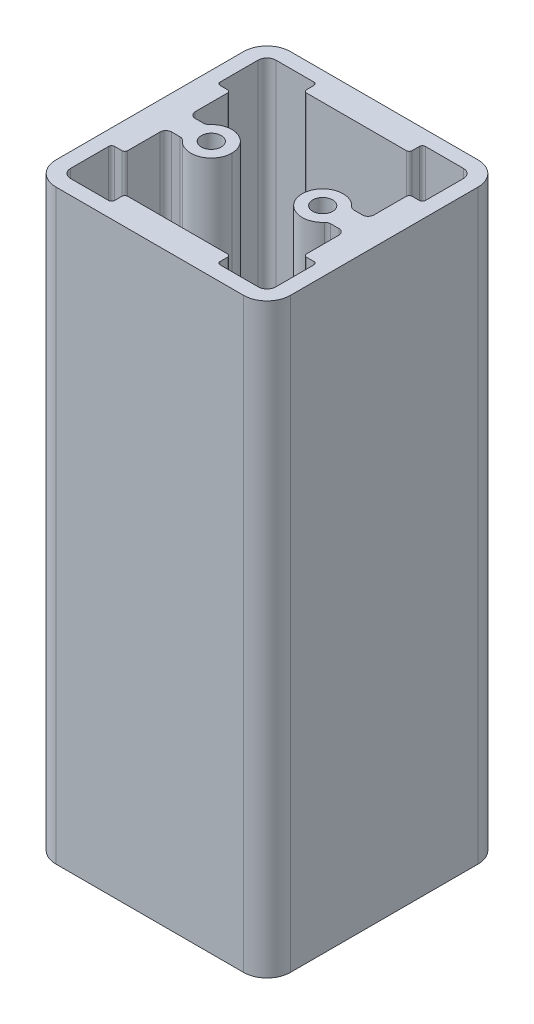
ISO-10303-21;
HEADER;
FILE_DESCRIPTION(('STEP AP214'),'2;1');
FILE_NAME('part.step','',(''),(''),'','','');
FILE_SCHEMA(('AUTOMOTIVE_DESIGN { 1 0 10303 214 1 1 1 1 }'));
ENDSEC;
DATA;
#1=APPLICATION_CONTEXT('core data for automotive mechanical design processes');
#2=APPLICATION_PROTOCOL_DEFINITION('international standard','automotive_design',2000,#1);
#3=PRODUCT_CONTEXT('',#1,'mechanical');
#4=PRODUCT('Part','Part','',(#3));
#5=PRODUCT_RELATED_PRODUCT_CATEGORY('part','',(#4));
#6=PRODUCT_DEFINITION_FORMATION('','',#4);
#7=PRODUCT_DEFINITION_CONTEXT('part definition',#1,'design');
#8=PRODUCT_DEFINITION('design','',#6,#7);
#9=PRODUCT_DEFINITION_SHAPE('','',#8);
#10=(LENGTH_UNIT() NAMED_UNIT(*) SI_UNIT(.MILLI.,.METRE.));
#11=(NAMED_UNIT(*) PLANE_ANGLE_UNIT() SI_UNIT($,.RADIAN.));
#12=(NAMED_UNIT(*) SI_UNIT($,.STERADIAN.) SOLID_ANGLE_UNIT());
#13=UNCERTAINTY_MEASURE_WITH_UNIT(LENGTH_MEASURE(1.E-05),#10,'distance_accuracy_value','');
#14=(GEOMETRIC_REPRESENTATION_CONTEXT(3) GLOBAL_UNCERTAINTY_ASSIGNED_CONTEXT((#13)) GLOBAL_UNIT_ASSIGNED_CONTEXT((#10,
#11,#12)) REPRESENTATION_CONTEXT('',''));
#15=CARTESIAN_POINT('',(0.,0.,0.));
#16=DIRECTION('',(0.,0.,1.));
#17=DIRECTION('',(1.,0.,0.));
#18=AXIS2_PLACEMENT_3D('',#15,#16,#17);
#19=CARTESIAN_POINT('',(0.,-10.,0.));
#20=DIRECTION('',(0.,-1.,0.));
#21=DIRECTION('',(0.,0.,-1.));
#22=AXIS2_PLACEMENT_3D('',#19,#20,#21);
#23=PLANE('',#22);
#24=CARTESIAN_POINT('',(-17.,-10.,-9.5));
#25=DIRECTION('',(0.,1.,0.));
#26=DIRECTION('',(0.,0.,1.));
#27=AXIS2_PLACEMENT_3D('',#24,#25,#26);
#28=CIRCLE('',#27,0.5);
#29=CARTESIAN_POINT('',(-17.5,-10.,-9.5));
#30=VERTEX_POINT('',#29);
#31=CARTESIAN_POINT('',(-17.,-10.,-9.));
#32=VERTEX_POINT('',#31);
#33=EDGE_CURVE('E139',#30,#32,#28,.T.);
#34=ORIENTED_EDGE('',*,*,#33,.T.);
#35=DIRECTION('',(1.,0.,0.));
#36=VECTOR('',#35,1.);
#37=CARTESIAN_POINT('',(-8.1875,-10.,-9.));
#38=LINE('',#37,#36);
#39=CARTESIAN_POINT('',(-15.75,-10.,-9.));
#40=VERTEX_POINT('',#39);
#41=EDGE_CURVE('E290',#32,#40,#38,.T.);
#42=ORIENTED_EDGE('',*,*,#41,.T.);
#43=CARTESIAN_POINT('',(-15.75,-10.,-8.5));
#44=DIRECTION('',(0.,-1.,0.));
#45=DIRECTION('',(0.,0.,-1.));
#46=AXIS2_PLACEMENT_3D('',#43,#44,#45);
#47=CIRCLE('',#46,0.5);
#48=CARTESIAN_POINT('',(-15.25,-10.,-8.5));
#49=VERTEX_POINT('',#48);
#50=EDGE_CURVE('E274',#40,#49,#47,.T.);
#51=ORIENTED_EDGE('',*,*,#50,.T.);
#52=DIRECTION('',(0.,0.,1.));
#53=VECTOR('',#52,1.);
#54=CARTESIAN_POINT('',(-15.25,-10.,-2.875));
#55=LINE('',#54,#53);
#56=CARTESIAN_POINT('',(-15.25,-10.,-3.));
#57=VERTEX_POINT('',#56);
#58=EDGE_CURVE('E458',#49,#57,#55,.T.);
#59=ORIENTED_EDGE('',*,*,#58,.T.);
#60=CARTESIAN_POINT('',(-14.25,-10.,-3.));
#61=DIRECTION('',(0.,1.,0.));
#62=DIRECTION('',(0.,0.,1.));
#63=AXIS2_PLACEMENT_3D('',#60,#61,#62);
#64=CIRCLE('',#63,0.999999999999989);
#65=CARTESIAN_POINT('',(-14.25,-10.,-2.));
#66=VERTEX_POINT('',#65);
#67=EDGE_CURVE('E42',#57,#66,#64,.T.);
#68=ORIENTED_EDGE('',*,*,#67,.T.);
#69=DIRECTION('',(1.,0.,0.));
#70=VECTOR('',#69,1.);
#71=CARTESIAN_POINT('',(-6.77603029,-10.,-2.));
#72=LINE('',#71,#70);
#73=CARTESIAN_POINT('',(-12.85412116,-10.,-2.));
#74=VERTEX_POINT('',#73);
#75=EDGE_CURVE('E354',#66,#74,#72,.T.);
#76=ORIENTED_EDGE('',*,*,#75,.T.);
#77=CARTESIAN_POINT('',(-12.85412116,-10.,-3.));
#78=DIRECTION('',(0.,1.,0.));
#79=DIRECTION('',(0.745360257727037,0.,0.666661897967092));
#80=AXIS2_PLACEMENT_3D('',#77,#78,#79);
#81=CIRCLE('',#80,1.);
#82=CARTESIAN_POINT('',(-12.108760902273,-10.,-2.3333381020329));
#83=VERTEX_POINT('',#82);
#84=EDGE_CURVE('E410',#74,#83,#81,.T.);
#85=ORIENTED_EDGE('',*,*,#84,.T.);
#86=CARTESIAN_POINT('',(-9.5,-10.,-2.14499999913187E-05));
#87=DIRECTION('',(0.,-1.,0.));
#88=DIRECTION('',(-0.745360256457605,0.,-0.666661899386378));
#89=AXIS2_PLACEMENT_3D('',#86,#87,#88);
#90=CIRCLE('',#89,3.5000000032);
#91=CARTESIAN_POINT('',(-5.99999999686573,-10.,1.406874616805E-12));
#92=VERTEX_POINT('',#91);
#93=EDGE_CURVE('E409',#83,#92,#90,.T.);
#94=ORIENTED_EDGE('',*,*,#93,.T.);
#95=CARTESIAN_POINT('',(-9.5,-10.,2.14499999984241E-05));
#96=DIRECTION('',(0.,-1.,0.));
#97=DIRECTION('',(0.99999999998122,0.,-6.12857182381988E-06));
#98=AXIS2_PLACEMENT_3D('',#95,#96,#97);
#99=CIRCLE('',#98,3.5000000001);
#100=CARTESIAN_POINT('',(-12.1087608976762,-10.,2.33333809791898));
#101=VERTEX_POINT('',#100);
#102=EDGE_CURVE('E515',#92,#101,#99,.T.);
#103=ORIENTED_EDGE('',*,*,#102,.T.);
#104=CARTESIAN_POINT('',(-12.85412116,-10.,3.));
#105=DIRECTION('',(0.,1.,0.));
#106=DIRECTION('',(0.,0.,-1.));
#107=AXIS2_PLACEMENT_3D('',#104,#105,#106);
#108=CIRCLE('',#107,1.00000000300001);
#109=CARTESIAN_POINT('',(-12.85412116,-10.,1.999999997));
#110=VERTEX_POINT('',#109);
#111=EDGE_CURVE('E339',#101,#110,#108,.T.);
#112=ORIENTED_EDGE('',*,*,#111,.T.);
#113=DIRECTION('',(-1.,0.,0.));
#114=VECTOR('',#113,1.);
#115=CARTESIAN_POINT('',(-6.77603029,-10.,2.));
#116=LINE('',#115,#114);
#117=CARTESIAN_POINT('',(-14.25,-10.,2.));
#118=VERTEX_POINT('',#117);
#119=EDGE_CURVE('E448',#110,#118,#116,.T.);
#120=ORIENTED_EDGE('',*,*,#119,.T.);
#121=CARTESIAN_POINT('',(-14.25,-10.,3.));
#122=DIRECTION('',(0.,1.,0.));
#123=DIRECTION('',(-1.,0.,0.));
#124=AXIS2_PLACEMENT_3D('',#121,#122,#123);
#125=CIRCLE('',#124,1.);
#126=CARTESIAN_POINT('',(-15.25,-10.,3.));
#127=VERTEX_POINT('',#126);
#128=EDGE_CURVE('E572',#118,#127,#125,.T.);
#129=ORIENTED_EDGE('',*,*,#128,.T.);
#130=DIRECTION('',(0.,0.,1.));
#131=VECTOR('',#130,1.);
#132=CARTESIAN_POINT('',(-15.25,-10.,2.875));
#133=LINE('',#132,#131);
#134=CARTESIAN_POINT('',(-15.25,-10.,8.5));
#135=VERTEX_POINT('',#134);
#136=EDGE_CURVE('E426',#127,#135,#133,.T.);
#137=ORIENTED_EDGE('',*,*,#136,.T.);
#138=CARTESIAN_POINT('',(-15.75,-10.,8.5));
#139=DIRECTION('',(0.,-1.,0.));
#140=DIRECTION('',(1.,0.,0.));
#141=AXIS2_PLACEMENT_3D('',#138,#139,#140);
#142=CIRCLE('',#141,0.5);
#143=CARTESIAN_POINT('',(-15.75,-10.,9.));
#144=VERTEX_POINT('',#143);
#145=EDGE_CURVE('E575',#135,#144,#142,.T.);
#146=ORIENTED_EDGE('',*,*,#145,.T.);
#147=DIRECTION('',(-1.,0.,0.));
#148=VECTOR('',#147,1.);
#149=CARTESIAN_POINT('',(-8.1875,-10.,9.));
#150=LINE('',#149,#148);
#151=CARTESIAN_POINT('',(-17.,-10.,9.));
#152=VERTEX_POINT('',#151);
#153=EDGE_CURVE('E434',#144,#152,#150,.T.);
#154=ORIENTED_EDGE('',*,*,#153,.T.);
#155=CARTESIAN_POINT('',(-17.,-10.,9.5));
#156=DIRECTION('',(0.,1.,0.));
#157=DIRECTION('',(-1.,0.,0.));
#158=AXIS2_PLACEMENT_3D('',#155,#156,#157);
#159=CIRCLE('',#158,0.5);
#160=CARTESIAN_POINT('',(-17.5,-10.,9.5));
#161=VERTEX_POINT('',#160);
#162=EDGE_CURVE('E471',#152,#161,#159,.T.);
#163=ORIENTED_EDGE('',*,*,#162,.T.);
#164=DIRECTION('',(0.,0.,1.));
#165=VECTOR('',#164,1.);
#166=CARTESIAN_POINT('',(-17.5,-10.,6.375));
#167=LINE('',#166,#165);
#168=CARTESIAN_POINT('',(-17.5,-10.,16.));
#169=VERTEX_POINT('',#168);
#170=EDGE_CURVE('E470',#161,#169,#167,.T.);
#171=ORIENTED_EDGE('',*,*,#170,.T.);
#172=CARTESIAN_POINT('',(-16.,-10.,16.));
#173=DIRECTION('',(0.,1.,0.));
#174=DIRECTION('',(0.,0.,1.));
#175=AXIS2_PLACEMENT_3D('',#172,#173,#174);
#176=CIRCLE('',#175,1.5);
#177=CARTESIAN_POINT('',(-16.,-10.,17.5));
#178=VERTEX_POINT('',#177);
#179=EDGE_CURVE('E475',#169,#178,#176,.T.);
#180=ORIENTED_EDGE('',*,*,#179,.T.);
#181=DIRECTION('',(1.,0.,0.));
#182=VECTOR('',#181,1.);
#183=CARTESIAN_POINT('',(-6.375,-10.,17.5));
#184=LINE('',#183,#182);
#185=CARTESIAN_POINT('',(-9.5,-10.,17.5));
#186=VERTEX_POINT('',#185);
#187=EDGE_CURVE('E415',#178,#186,#184,.T.);
#188=ORIENTED_EDGE('',*,*,#187,.T.);
#189=CARTESIAN_POINT('',(-9.5,-10.,17.));
#190=DIRECTION('',(0.,1.,0.));
#191=DIRECTION('',(1.,0.,0.));
#192=AXIS2_PLACEMENT_3D('',#189,#190,#191);
#193=CIRCLE('',#192,0.5);
#194=CARTESIAN_POINT('',(-9.,-10.,17.));
#195=VERTEX_POINT('',#194);
#196=EDGE_CURVE('E414',#186,#195,#193,.T.);
#197=ORIENTED_EDGE('',*,*,#196,.T.);
#198=DIRECTION('',(0.,0.,-1.));
#199=VECTOR('',#198,1.);
#200=CARTESIAN_POINT('',(-9.,-10.,8.1875));
#201=LINE('',#200,#199);
#202=CARTESIAN_POINT('',(-9.,-10.,15.75));
#203=VERTEX_POINT('',#202);
#204=EDGE_CURVE('E303',#195,#203,#201,.T.);
#205=ORIENTED_EDGE('',*,*,#204,.T.);
#206=CARTESIAN_POINT('',(-8.5,-10.,15.75));
#207=DIRECTION('',(0.,-1.,0.));
#208=DIRECTION('',(-1.,0.,0.));
#209=AXIS2_PLACEMENT_3D('',#206,#207,#208);
#210=CIRCLE('',#209,0.5);
#211=CARTESIAN_POINT('',(-8.5,-10.,15.25));
#212=VERTEX_POINT('',#211);
#213=EDGE_CURVE('E649',#203,#212,#210,.T.);
#214=ORIENTED_EDGE('',*,*,#213,.T.);
#215=DIRECTION('',(1.,0.,0.));
#216=VECTOR('',#215,1.);
#217=CARTESIAN_POINT('',(2.125,-10.,15.25));
#218=LINE('',#217,#216);
#219=CARTESIAN_POINT('',(8.5,-10.,15.25));
#220=VERTEX_POINT('',#219);
#221=EDGE_CURVE('E476',#212,#220,#218,.T.);
#222=ORIENTED_EDGE('',*,*,#221,.T.);
#223=CARTESIAN_POINT('',(8.5,-10.,15.75));
#224=DIRECTION('',(0.,-1.,0.));
#225=DIRECTION('',(0.,0.,-1.));
#226=AXIS2_PLACEMENT_3D('',#223,#224,#225);
#227=CIRCLE('',#226,0.500000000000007);
#228=CARTESIAN_POINT('',(9.,-10.,15.75));
#229=VERTEX_POINT('',#228);
#230=EDGE_CURVE('E590',#220,#229,#227,.T.);
#231=ORIENTED_EDGE('',*,*,#230,.T.);
#232=DIRECTION('',(0.,0.,1.));
#233=VECTOR('',#232,1.);
#234=CARTESIAN_POINT('',(9.,-10.,8.1875));
#235=LINE('',#234,#233);
#236=CARTESIAN_POINT('',(9.,-10.,17.));
#237=VERTEX_POINT('',#236);
#238=EDGE_CURVE('E530',#229,#237,#235,.T.);
#239=ORIENTED_EDGE('',*,*,#238,.T.);
#240=CARTESIAN_POINT('',(9.5,-10.,17.));
#241=DIRECTION('',(0.,1.,0.));
#242=DIRECTION('',(0.,0.,1.));
#243=AXIS2_PLACEMENT_3D('',#240,#241,#242);
#244=CIRCLE('',#243,0.500000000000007);
#245=CARTESIAN_POINT('',(9.5,-10.,17.5));
#246=VERTEX_POINT('',#245);
#247=EDGE_CURVE('E529',#237,#246,#244,.T.);
#248=ORIENTED_EDGE('',*,*,#247,.T.);
#249=DIRECTION('',(1.,0.,0.));
#250=VECTOR('',#249,1.);
#251=CARTESIAN_POINT('',(6.375,-10.,17.5));
#252=LINE('',#251,#250);
#253=CARTESIAN_POINT('',(16.,-10.,17.5));
#254=VERTEX_POINT('',#253);
#255=EDGE_CURVE('E519',#246,#254,#252,.T.);
#256=ORIENTED_EDGE('',*,*,#255,.T.);
#257=CARTESIAN_POINT('',(16.,-10.,16.));
#258=DIRECTION('',(0.,1.,0.));
#259=DIRECTION('',(1.,0.,0.));
#260=AXIS2_PLACEMENT_3D('',#257,#258,#259);
#261=CIRCLE('',#260,1.5);
#262=CARTESIAN_POINT('',(17.5,-10.,16.));
#263=VERTEX_POINT('',#262);
#264=EDGE_CURVE('E421',#254,#263,#261,.T.);
#265=ORIENTED_EDGE('',*,*,#264,.T.);
#266=DIRECTION('',(0.,0.,-1.));
#267=VECTOR('',#266,1.);
#268=CARTESIAN_POINT('',(17.5,-10.,6.375));
#269=LINE('',#268,#267);
#270=CARTESIAN_POINT('',(17.5,-10.,9.5));
#271=VERTEX_POINT('',#270);
#272=EDGE_CURVE('E454',#263,#271,#269,.T.);
#273=ORIENTED_EDGE('',*,*,#272,.T.);
#274=CARTESIAN_POINT('',(17.,-10.,9.5));
#275=DIRECTION('',(0.,1.,0.));
#276=DIRECTION('',(0.,0.,-1.));
#277=AXIS2_PLACEMENT_3D('',#274,#275,#276);
#278=CIRCLE('',#277,0.500000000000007);
#279=CARTESIAN_POINT('',(17.,-10.,9.));
#280=VERTEX_POINT('',#279);
#281=EDGE_CURVE('E555',#271,#280,#278,.T.);
#282=ORIENTED_EDGE('',*,*,#281,.T.);
#283=DIRECTION('',(-1.,0.,0.));
#284=VECTOR('',#283,1.);
#285=CARTESIAN_POINT('',(8.1875,-10.,9.));
#286=LINE('',#285,#284);
#287=CARTESIAN_POINT('',(15.75,-10.,9.));
#288=VERTEX_POINT('',#287);
#289=EDGE_CURVE('E466',#280,#288,#286,.T.);
#290=ORIENTED_EDGE('',*,*,#289,.T.);
#291=CARTESIAN_POINT('',(15.75,-10.,8.5));
#292=DIRECTION('',(0.,-1.,0.));
#293=DIRECTION('',(0.,0.,1.));
#294=AXIS2_PLACEMENT_3D('',#291,#292,#293);
#295=CIRCLE('',#294,0.500000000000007);
#296=CARTESIAN_POINT('',(15.25,-10.,8.5));
#297=VERTEX_POINT('',#296);
#298=EDGE_CURVE('E390',#288,#297,#295,.T.);
#299=ORIENTED_EDGE('',*,*,#298,.T.);
#300=DIRECTION('',(0.,0.,-1.));
#301=VECTOR('',#300,1.);
#302=CARTESIAN_POINT('',(15.25,-10.,2.875));
#303=LINE('',#302,#301);
#304=CARTESIAN_POINT('',(15.25,-10.,3.));
#305=VERTEX_POINT('',#304);
#306=EDGE_CURVE('E389',#297,#305,#303,.T.);
#307=ORIENTED_EDGE('',*,*,#306,.T.);
#308=CARTESIAN_POINT('',(14.25,-10.,3.));
#309=DIRECTION('',(0.,1.,0.));
#310=DIRECTION('',(0.,0.,-1.));
#311=AXIS2_PLACEMENT_3D('',#308,#309,#310);
#312=CIRCLE('',#311,0.999999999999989);
#313=CARTESIAN_POINT('',(14.25,-10.,2.));
#314=VERTEX_POINT('',#313);
#315=EDGE_CURVE('E395',#305,#314,#312,.T.);
#316=ORIENTED_EDGE('',*,*,#315,.T.);
#317=DIRECTION('',(-1.,0.,0.));
#318=VECTOR('',#317,1.);
#319=CARTESIAN_POINT('',(6.77603029,-10.,2.));
#320=LINE('',#319,#318);
#321=CARTESIAN_POINT('',(12.85412116,-10.,2.));
#322=VERTEX_POINT('',#321);
#323=EDGE_CURVE('E394',#314,#322,#320,.T.);
#324=ORIENTED_EDGE('',*,*,#323,.T.);
#325=CARTESIAN_POINT('',(12.85412116,-10.,3.00000000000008));
#326=DIRECTION('',(0.,1.,0.));
#327=DIRECTION('',(-0.745360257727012,0.,-0.66666189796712));
#328=AXIS2_PLACEMENT_3D('',#325,#326,#327);
#329=CIRCLE('',#328,1.00000000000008);
#330=CARTESIAN_POINT('',(12.108760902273,-10.,2.3333381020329));
#331=VERTEX_POINT('',#330);
#332=EDGE_CURVE('E487',#322,#331,#329,.T.);
#333=ORIENTED_EDGE('',*,*,#332,.T.);
#334=CARTESIAN_POINT('',(9.5,-10.,2.14499999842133E-05));
#335=DIRECTION('',(0.,-1.,0.));
#336=DIRECTION('',(0.745360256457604,0.,0.66666189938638));
#337=AXIS2_PLACEMENT_3D('',#334,#335,#336);
#338=CIRCLE('',#337,3.50000000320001);
#339=CARTESIAN_POINT('',(5.99999999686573,-10.,-1.406874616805E-12));
#340=VERTEX_POINT('',#339);
#341=EDGE_CURVE('E326',#331,#340,#338,.T.);
#342=ORIENTED_EDGE('',*,*,#341,.T.);
#343=CARTESIAN_POINT('',(9.5,-10.,-2.14499999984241E-05));
#344=DIRECTION('',(0.,-1.,0.));
#345=DIRECTION('',(-0.99999999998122,0.,6.12857182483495E-06));
#346=AXIS2_PLACEMENT_3D('',#343,#344,#345);
#347=CIRCLE('',#346,3.5000000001);
#348=CARTESIAN_POINT('',(12.1087608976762,-10.,-2.33333809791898));
#349=VERTEX_POINT('',#348);
#350=EDGE_CURVE('E322',#340,#349,#347,.T.);
#351=ORIENTED_EDGE('',*,*,#350,.T.);
#352=CARTESIAN_POINT('',(12.85412116,-10.,-3.));
#353=DIRECTION('',(0.,1.,0.));
#354=DIRECTION('',(0.,0.,1.));
#355=AXIS2_PLACEMENT_3D('',#352,#353,#354);
#356=CIRCLE('',#355,1.00000000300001);
#357=CARTESIAN_POINT('',(12.85412116,-10.,-1.999999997));
#358=VERTEX_POINT('',#357);
#359=EDGE_CURVE('E321',#349,#358,#356,.T.);
#360=ORIENTED_EDGE('',*,*,#359,.T.);
#361=DIRECTION('',(1.,0.,0.));
#362=VECTOR('',#361,1.);
#363=CARTESIAN_POINT('',(6.77603029,-10.,-2.));
#364=LINE('',#363,#362);
#365=CARTESIAN_POINT('',(14.25,-10.,-2.));
#366=VERTEX_POINT('',#365);
#367=EDGE_CURVE('E502',#358,#366,#364,.T.);
#368=ORIENTED_EDGE('',*,*,#367,.T.);
#369=CARTESIAN_POINT('',(14.25,-10.,-3.));
#370=DIRECTION('',(0.,1.,0.));
#371=DIRECTION('',(1.,0.,0.));
#372=AXIS2_PLACEMENT_3D('',#369,#370,#371);
#373=CIRCLE('',#372,1.);
#374=CARTESIAN_POINT('',(15.25,-10.,-3.));
#375=VERTEX_POINT('',#374);
#376=EDGE_CURVE('E417',#366,#375,#373,.T.);
#377=ORIENTED_EDGE('',*,*,#376,.T.);
#378=DIRECTION('',(0.,0.,-1.));
#379=VECTOR('',#378,1.);
#380=CARTESIAN_POINT('',(15.25,-10.,-2.875));
#381=LINE('',#380,#379);
#382=CARTESIAN_POINT('',(15.25,-10.,-8.5));
#383=VERTEX_POINT('',#382);
#384=EDGE_CURVE('E349',#375,#383,#381,.T.);
#385=ORIENTED_EDGE('',*,*,#384,.T.);
#386=CARTESIAN_POINT('',(15.75,-10.,-8.5));
#387=DIRECTION('',(0.,-1.,0.));
#388=DIRECTION('',(-1.,0.,0.));
#389=AXIS2_PLACEMENT_3D('',#386,#387,#388);
#390=CIRCLE('',#389,0.500000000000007);
#391=CARTESIAN_POINT('',(15.75,-10.,-9.));
#392=VERTEX_POINT('',#391);
#393=EDGE_CURVE('E376',#383,#392,#390,.T.);
#394=ORIENTED_EDGE('',*,*,#393,.T.);
#395=DIRECTION('',(1.,0.,0.));
#396=VECTOR('',#395,1.);
#397=CARTESIAN_POINT('',(8.1875,-10.,-9.));
#398=LINE('',#397,#396);
#399=CARTESIAN_POINT('',(17.,-10.,-9.));
#400=VERTEX_POINT('',#399);
#401=EDGE_CURVE('E365',#392,#400,#398,.T.);
#402=ORIENTED_EDGE('',*,*,#401,.T.);
#403=CARTESIAN_POINT('',(17.,-10.,-9.5));
#404=DIRECTION('',(0.,1.,0.));
#405=DIRECTION('',(1.,0.,0.));
#406=AXIS2_PLACEMENT_3D('',#403,#404,#405);
#407=CIRCLE('',#406,0.500000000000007);
#408=CARTESIAN_POINT('',(17.5,-10.,-9.5));
#409=VERTEX_POINT('',#408);
#410=EDGE_CURVE('E364',#400,#409,#407,.T.);
#411=ORIENTED_EDGE('',*,*,#410,.T.);
#412=DIRECTION('',(0.,0.,-1.));
#413=VECTOR('',#412,1.);
#414=CARTESIAN_POINT('',(17.5,-10.,-6.375));
#415=LINE('',#414,#413);
#416=CARTESIAN_POINT('',(17.5,-10.,-16.));
#417=VERTEX_POINT('',#416);
#418=EDGE_CURVE('E313',#409,#417,#415,.T.);
#419=ORIENTED_EDGE('',*,*,#418,.T.);
#420=CARTESIAN_POINT('',(16.,-10.,-16.));
#421=DIRECTION('',(0.,1.,0.));
#422=DIRECTION('',(0.,0.,-1.));
#423=AXIS2_PLACEMENT_3D('',#420,#421,#422);
#424=CIRCLE('',#423,1.5);
#425=CARTESIAN_POINT('',(16.,-10.,-17.5));
#426=VERTEX_POINT('',#425);
#427=EDGE_CURVE('E382',#417,#426,#424,.T.);
#428=ORIENTED_EDGE('',*,*,#427,.T.);
#429=DIRECTION('',(-1.,0.,0.));
#430=VECTOR('',#429,1.);
#431=CARTESIAN_POINT('',(6.375,-10.,-17.5));
#432=LINE('',#431,#430);
#433=CARTESIAN_POINT('',(9.5,-10.,-17.5));
#434=VERTEX_POINT('',#433);
#435=EDGE_CURVE('E488',#426,#434,#432,.T.);
#436=ORIENTED_EDGE('',*,*,#435,.T.);
#437=CARTESIAN_POINT('',(9.5,-10.,-17.));
#438=DIRECTION('',(0.,1.,0.));
#439=DIRECTION('',(-1.,0.,0.));
#440=AXIS2_PLACEMENT_3D('',#437,#438,#439);
#441=CIRCLE('',#440,0.500000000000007);
#442=CARTESIAN_POINT('',(9.,-10.,-17.));
#443=VERTEX_POINT('',#442);
#444=EDGE_CURVE('E512',#434,#443,#441,.T.);
#445=ORIENTED_EDGE('',*,*,#444,.T.);
#446=DIRECTION('',(0.,0.,1.));
#447=VECTOR('',#446,1.);
#448=CARTESIAN_POINT('',(9.,-10.,-8.1875));
#449=LINE('',#448,#447);
#450=CARTESIAN_POINT('',(9.,-10.,-15.75));
#451=VERTEX_POINT('',#450);
#452=EDGE_CURVE('E335',#443,#451,#449,.T.);
#453=ORIENTED_EDGE('',*,*,#452,.T.);
#454=CARTESIAN_POINT('',(8.5,-10.,-15.75));
#455=DIRECTION('',(0.,-1.,0.));
#456=DIRECTION('',(1.,0.,0.));
#457=AXIS2_PLACEMENT_3D('',#454,#455,#456);
#458=CIRCLE('',#457,0.500000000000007);
#459=CARTESIAN_POINT('',(8.5,-10.,-15.25));
#460=VERTEX_POINT('',#459);
#461=EDGE_CURVE('E308',#451,#460,#458,.T.);
#462=ORIENTED_EDGE('',*,*,#461,.T.);
#463=DIRECTION('',(-1.,0.,0.));
#464=VECTOR('',#463,1.);
#465=CARTESIAN_POINT('',(-2.125,-10.,-15.25));
#466=LINE('',#465,#464);
#467=CARTESIAN_POINT('',(-8.5,-10.,-15.25));
#468=VERTEX_POINT('',#467);
#469=EDGE_CURVE('E455',#460,#468,#466,.T.);
#470=ORIENTED_EDGE('',*,*,#469,.T.);
#471=CARTESIAN_POINT('',(-8.5,-10.,-15.75));
#472=DIRECTION('',(0.,-1.,0.));
#473=DIRECTION('',(0.,0.,1.));
#474=AXIS2_PLACEMENT_3D('',#471,#472,#473);
#475=CIRCLE('',#474,0.5);
#476=CARTESIAN_POINT('',(-9.,-10.,-15.75));
#477=VERTEX_POINT('',#476);
#478=EDGE_CURVE('E444',#468,#477,#475,.T.);
#479=ORIENTED_EDGE('',*,*,#478,.T.);
#480=DIRECTION('',(0.,0.,-1.));
#481=VECTOR('',#480,1.);
#482=CARTESIAN_POINT('',(-9.,-10.,-8.1875));
#483=LINE('',#482,#481);
#484=CARTESIAN_POINT('',(-9.,-10.,-17.));
#485=VERTEX_POINT('',#484);
#486=EDGE_CURVE('E327',#477,#485,#483,.T.);
#487=ORIENTED_EDGE('',*,*,#486,.T.);
#488=CARTESIAN_POINT('',(-9.5,-10.,-17.));
#489=DIRECTION('',(0.,1.,0.));
#490=DIRECTION('',(0.,0.,-1.));
#491=AXIS2_PLACEMENT_3D('',#488,#489,#490);
#492=CIRCLE('',#491,0.5);
#493=CARTESIAN_POINT('',(-9.5,-10.,-17.5));
#494=VERTEX_POINT('',#493);
#495=EDGE_CURVE('E483',#485,#494,#492,.T.);
#496=ORIENTED_EDGE('',*,*,#495,.T.);
#497=DIRECTION('',(-1.,0.,0.));
#498=VECTOR('',#497,1.);
#499=CARTESIAN_POINT('',(-6.375,-10.,-17.5));
#500=LINE('',#499,#498);
#501=CARTESIAN_POINT('',(-16.,-10.,-17.5));
#502=VERTEX_POINT('',#501);
#503=EDGE_CURVE('E400',#494,#502,#500,.T.);
#504=ORIENTED_EDGE('',*,*,#503,.T.);
#505=CARTESIAN_POINT('',(-16.,-10.,-16.));
#506=DIRECTION('',(0.,1.,0.));
#507=DIRECTION('',(-1.,0.,0.));
#508=AXIS2_PLACEMENT_3D('',#505,#506,#507);
#509=CIRCLE('',#508,1.5);
#510=CARTESIAN_POINT('',(-17.5,-10.,-16.));
#511=VERTEX_POINT('',#510);
#512=EDGE_CURVE('E399',#502,#511,#509,.T.);
#513=ORIENTED_EDGE('',*,*,#512,.T.);
#514=DIRECTION('',(0.,0.,1.));
#515=VECTOR('',#514,1.);
#516=CARTESIAN_POINT('',(-17.5,-10.,-6.375));
#517=LINE('',#516,#515);
#518=EDGE_CURVE('E149',#511,#30,#517,.T.);
#519=ORIENTED_EDGE('',*,*,#518,.T.);
#520=EDGE_LOOP('',(#34,#42,#51,#59,#68,#76,#85,#94,#103,#112,#120,#129,#137,#146,#154,#163,#171,
#180,#188,#197,#205,#214,#222,#231,#239,#248,#256,#265,#273,#282,#290,#299,#307,#316,#324,#333,
#342,#351,#360,#368,#377,#385,#394,#402,#411,#419,#428,#436,#445,#453,#462,#470,#479,#487,#496,
#504,#513,#519));
#521=FACE_BOUND('',#520,.T.);
#522=CARTESIAN_POINT('',(-9.5,-10.,0.));
#523=DIRECTION('',(0.,1.,0.));
#524=DIRECTION('',(1.,0.,0.));
#525=AXIS2_PLACEMENT_3D('',#522,#523,#524);
#526=CIRCLE('',#525,1.7);
#527=CARTESIAN_POINT('',(-11.2,-10.,0.));
#528=VERTEX_POINT('',#527);
#529=CARTESIAN_POINT('',(-7.8,-10.,0.));
#530=VERTEX_POINT('',#529);
#531=EDGE_CURVE('E495',#528,#530,#526,.T.);
#532=ORIENTED_EDGE('',*,*,#531,.T.);
#533=CARTESIAN_POINT('',(-9.5,-10.,0.));
#534=DIRECTION('',(0.,1.,0.));
#535=DIRECTION('',(1.,0.,0.));
#536=AXIS2_PLACEMENT_3D('',#533,#534,#535);
#537=CIRCLE('',#536,1.7);
#538=EDGE_CURVE('E301',#530,#528,#537,.T.);
#539=ORIENTED_EDGE('',*,*,#538,.T.);
#540=EDGE_LOOP('',(#532,#539));
#541=FACE_BOUND('',#540,.T.);
#542=CARTESIAN_POINT('',(9.5,-10.,0.));
#543=DIRECTION('',(0.,1.,0.));
#544=DIRECTION('',(1.,0.,0.));
#545=AXIS2_PLACEMENT_3D('',#542,#543,#544);
#546=CIRCLE('',#545,1.7);
#547=CARTESIAN_POINT('',(7.8,-10.,0.));
#548=VERTEX_POINT('',#547);
#549=CARTESIAN_POINT('',(11.2,-10.,0.));
#550=VERTEX_POINT('',#549);
#551=EDGE_CURVE('E547',#548,#550,#546,.T.);
#552=ORIENTED_EDGE('',*,*,#551,.T.);
#553=CARTESIAN_POINT('',(9.5,-10.,0.));
#554=DIRECTION('',(0.,1.,0.));
#555=DIRECTION('',(1.,0.,0.));
#556=AXIS2_PLACEMENT_3D('',#553,#554,#555);
#557=CIRCLE('',#556,1.7);
#558=EDGE_CURVE('E548',#550,#548,#557,.T.);
#559=ORIENTED_EDGE('',*,*,#558,.T.);
#560=EDGE_LOOP('',(#552,#559));
#561=FACE_BOUND('',#560,.T.);
#562=DIRECTION('',(0.,0.,1.));
#563=VECTOR('',#562,1.);
#564=CARTESIAN_POINT('',(-20.,-10.,16.));
#565=LINE('',#564,#563);
#566=CARTESIAN_POINT('',(-20.,-10.,-16.));
#567=VERTEX_POINT('',#566);
#568=CARTESIAN_POINT('',(-20.,-10.,16.));
#569=VERTEX_POINT('',#568);
#570=EDGE_CURVE('E558',#567,#569,#565,.T.);
#571=ORIENTED_EDGE('',*,*,#570,.F.);
#572=CARTESIAN_POINT('',(-16.,-10.,-16.));
#573=DIRECTION('',(0.,1.,0.));
#574=DIRECTION('',(-1.,0.,0.));
#575=AXIS2_PLACEMENT_3D('',#572,#573,#574);
#576=CIRCLE('',#575,4.);
#577=CARTESIAN_POINT('',(-16.,-10.,-20.));
#578=VERTEX_POINT('',#577);
#579=EDGE_CURVE('E11',#578,#567,#576,.T.);
#580=ORIENTED_EDGE('',*,*,#579,.F.);
#581=DIRECTION('',(-1.,0.,0.));
#582=VECTOR('',#581,1.);
#583=CARTESIAN_POINT('',(-16.,-10.,-20.));
#584=LINE('',#583,#582);
#585=CARTESIAN_POINT('',(16.,-10.,-20.));
#586=VERTEX_POINT('',#585);
#587=EDGE_CURVE('E506',#586,#578,#584,.T.);
#588=ORIENTED_EDGE('',*,*,#587,.F.);
#589=CARTESIAN_POINT('',(16.,-10.,-16.));
#590=DIRECTION('',(0.,1.,0.));
#591=DIRECTION('',(0.,0.,-1.));
#592=AXIS2_PLACEMENT_3D('',#589,#590,#591);
#593=CIRCLE('',#592,4.);
#594=CARTESIAN_POINT('',(20.,-10.,-16.));
#595=VERTEX_POINT('',#594);
#596=EDGE_CURVE('E646',#595,#586,#593,.T.);
#597=ORIENTED_EDGE('',*,*,#596,.F.);
#598=DIRECTION('',(0.,0.,-1.));
#599=VECTOR('',#598,1.);
#600=CARTESIAN_POINT('',(20.,-10.,-16.));
#601=LINE('',#600,#599);
#602=CARTESIAN_POINT('',(20.,-10.,16.));
#603=VERTEX_POINT('',#602);
#604=EDGE_CURVE('E347',#603,#595,#601,.T.);
#605=ORIENTED_EDGE('',*,*,#604,.F.);
#606=CARTESIAN_POINT('',(16.,-10.,16.));
#607=DIRECTION('',(0.,1.,0.));
#608=DIRECTION('',(1.,0.,0.));
#609=AXIS2_PLACEMENT_3D('',#606,#607,#608);
#610=CIRCLE('',#609,4.);
#611=CARTESIAN_POINT('',(16.,-10.,20.));
#612=VERTEX_POINT('',#611);
#613=EDGE_CURVE('E348',#612,#603,#610,.T.);
#614=ORIENTED_EDGE('',*,*,#613,.F.);
#615=DIRECTION('',(1.,0.,0.));
#616=VECTOR('',#615,1.);
#617=CARTESIAN_POINT('',(16.,-10.,20.));
#618=LINE('',#617,#616);
#619=CARTESIAN_POINT('',(-16.,-10.,20.));
#620=VERTEX_POINT('',#619);
#621=EDGE_CURVE('E361',#620,#612,#618,.T.);
#622=ORIENTED_EDGE('',*,*,#621,.F.);
#623=CARTESIAN_POINT('',(-16.,-10.,16.));
#624=DIRECTION('',(0.,1.,0.));
#625=DIRECTION('',(0.,0.,1.));
#626=AXIS2_PLACEMENT_3D('',#623,#624,#625);
#627=CIRCLE('',#626,4.);
#628=EDGE_CURVE('E442',#569,#620,#627,.T.);
#629=ORIENTED_EDGE('',*,*,#628,.F.);
#630=EDGE_LOOP('',(#571,#580,#588,#597,#605,#614,#622,#629));
#631=FACE_BOUND('',#630,.T.);
#632=ADVANCED_FACE('F38',(#521,#541,#561,#631),#23,.T.);
#633=CARTESIAN_POINT('',(-16.,10.,-16.));
#634=DIRECTION('',(0.,-1.,0.));
#635=DIRECTION('',(-1.,0.,0.));
#636=AXIS2_PLACEMENT_3D('',#633,#634,#635);
#637=CYLINDRICAL_SURFACE('',#636,4.);
#638=ORIENTED_EDGE('',*,*,#579,.T.);
#639=DIRECTION('',(0.,-1.,0.));
#640=VECTOR('',#639,1.);
#641=CARTESIAN_POINT('',(-20.,10.,-16.));
#642=LINE('',#641,#640);
#643=CARTESIAN_POINT('',(-20.,90.,-16.));
#644=VERTEX_POINT('',#643);
#645=EDGE_CURVE('E439',#644,#567,#642,.T.);
#646=ORIENTED_EDGE('',*,*,#645,.F.);
#647=CARTESIAN_POINT('',(-16.,90.,-16.));
#648=DIRECTION('',(0.,1.,0.));
#649=DIRECTION('',(0.,0.,1.));
#650=AXIS2_PLACEMENT_3D('',#647,#648,#649);
#651=CIRCLE('',#650,4.);
#652=CARTESIAN_POINT('',(-16.,90.,-20.));
#653=VERTEX_POINT('',#652);
#654=EDGE_CURVE('E816',#653,#644,#651,.T.);
#655=ORIENTED_EDGE('',*,*,#654,.F.);
#656=DIRECTION('',(0.,-1.,0.));
#657=VECTOR('',#656,1.);
#658=CARTESIAN_POINT('',(-16.,10.,-20.));
#659=LINE('',#658,#657);
#660=EDGE_CURVE('E48',#653,#578,#659,.T.);
#661=ORIENTED_EDGE('',*,*,#660,.T.);
#662=EDGE_LOOP('',(#638,#646,#655,#661));
#663=FACE_BOUND('',#662,.T.);
#664=ADVANCED_FACE('F899',(#663),#637,.T.);
#665=CARTESIAN_POINT('',(0.,10.,-20.));
#666=DIRECTION('',(0.,0.,-1.));
#667=DIRECTION('',(0.,-1.,0.));
#668=AXIS2_PLACEMENT_3D('',#665,#666,#667);
#669=PLANE('',#668);
#670=CARTESIAN_POINT('',(0.,60.,-20.));
#671=DIRECTION('',(0.,0.,-1.));
#672=DIRECTION('',(-1.,0.,0.));
#673=AXIS2_PLACEMENT_3D('',#670,#671,#672);
#674=CIRCLE('',#673,3.);
#675=CARTESIAN_POINT('',(-3.,60.,-20.));
#676=VERTEX_POINT('',#675);
#677=EDGE_CURVE('E1430',#676,#676,#674,.T.);
#678=ORIENTED_EDGE('',*,*,#677,.F.);
#679=EDGE_LOOP('',(#678));
#680=FACE_BOUND('',#679,.T.);
#681=ORIENTED_EDGE('',*,*,#587,.T.);
#682=ORIENTED_EDGE('',*,*,#660,.F.);
#683=DIRECTION('',(-1.,0.,0.));
#684=VECTOR('',#683,1.);
#685=CARTESIAN_POINT('',(16.,90.,-20.));
#686=LINE('',#685,#684);
#687=CARTESIAN_POINT('',(16.,90.,-20.));
#688=VERTEX_POINT('',#687);
#689=EDGE_CURVE('E604',#688,#653,#686,.T.);
#690=ORIENTED_EDGE('',*,*,#689,.F.);
#691=DIRECTION('',(0.,-1.,0.));
#692=VECTOR('',#691,1.);
#693=CARTESIAN_POINT('',(16.,10.,-20.));
#694=LINE('',#693,#692);
#695=EDGE_CURVE('E544',#688,#586,#694,.T.);
#696=ORIENTED_EDGE('',*,*,#695,.T.);
#697=EDGE_LOOP('',(#681,#682,#690,#696));
#698=FACE_BOUND('',#697,.T.);
#699=ADVANCED_FACE('F974',(#680,#698),#669,.T.);
#700=CARTESIAN_POINT('',(16.,10.,-16.));
#701=DIRECTION('',(0.,-1.,0.));
#702=DIRECTION('',(0.,0.,-1.));
#703=AXIS2_PLACEMENT_3D('',#700,#701,#702);
#704=CYLINDRICAL_SURFACE('',#703,4.);
#705=ORIENTED_EDGE('',*,*,#596,.T.);
#706=ORIENTED_EDGE('',*,*,#695,.F.);
#707=CARTESIAN_POINT('',(16.,90.,-16.));
#708=DIRECTION('',(0.,1.,0.));
#709=DIRECTION('',(0.,0.,1.));
#710=AXIS2_PLACEMENT_3D('',#707,#708,#709);
#711=CIRCLE('',#710,4.);
#712=CARTESIAN_POINT('',(20.,90.,-16.));
#713=VERTEX_POINT('',#712);
#714=EDGE_CURVE('E834',#713,#688,#711,.T.);
#715=ORIENTED_EDGE('',*,*,#714,.F.);
#716=DIRECTION('',(0.,-1.,0.));
#717=VECTOR('',#716,1.);
#718=CARTESIAN_POINT('',(20.,10.,-16.));
#719=LINE('',#718,#717);
#720=EDGE_CURVE('E540',#713,#595,#719,.T.);
#721=ORIENTED_EDGE('',*,*,#720,.T.);
#722=EDGE_LOOP('',(#705,#706,#715,#721));
#723=FACE_BOUND('',#722,.T.);
#724=ADVANCED_FACE('F971',(#723),#704,.T.);
#725=CARTESIAN_POINT('',(20.,10.,0.));
#726=DIRECTION('',(1.,0.,0.));
#727=DIRECTION('',(0.,1.,0.));
#728=AXIS2_PLACEMENT_3D('',#725,#726,#727);
#729=PLANE('',#728);
#730=ORIENTED_EDGE('',*,*,#604,.T.);
#731=ORIENTED_EDGE('',*,*,#720,.F.);
#732=DIRECTION('',(0.,0.,-1.));
#733=VECTOR('',#732,1.);
#734=CARTESIAN_POINT('',(20.,90.,16.));
#735=LINE('',#734,#733);
#736=CARTESIAN_POINT('',(20.,90.,16.));
#737=VERTEX_POINT('',#736);
#738=EDGE_CURVE('E831',#737,#713,#735,.T.);
#739=ORIENTED_EDGE('',*,*,#738,.F.);
#740=DIRECTION('',(0.,-1.,0.));
#741=VECTOR('',#740,1.);
#742=CARTESIAN_POINT('',(20.,10.,16.));
#743=LINE('',#742,#741);
#744=EDGE_CURVE('E344',#737,#603,#743,.T.);
#745=ORIENTED_EDGE('',*,*,#744,.T.);
#746=EDGE_LOOP('',(#730,#731,#739,#745));
#747=FACE_BOUND('',#746,.T.);
#748=ADVANCED_FACE('F964',(#747),#729,.T.);
#749=CARTESIAN_POINT('',(16.,10.,16.));
#750=DIRECTION('',(0.,-1.,0.));
#751=DIRECTION('',(1.,0.,0.));
#752=AXIS2_PLACEMENT_3D('',#749,#750,#751);
#753=CYLINDRICAL_SURFACE('',#752,4.);
#754=ORIENTED_EDGE('',*,*,#613,.T.);
#755=ORIENTED_EDGE('',*,*,#744,.F.);
#756=CARTESIAN_POINT('',(16.,90.,16.));
#757=DIRECTION('',(0.,1.,0.));
#758=DIRECTION('',(0.,0.,1.));
#759=AXIS2_PLACEMENT_3D('',#756,#757,#758);
#760=CIRCLE('',#759,4.);
#761=CARTESIAN_POINT('',(16.,90.,20.));
#762=VERTEX_POINT('',#761);
#763=EDGE_CURVE('E828',#762,#737,#760,.T.);
#764=ORIENTED_EDGE('',*,*,#763,.F.);
#765=DIRECTION('',(0.,-1.,0.));
#766=VECTOR('',#765,1.);
#767=CARTESIAN_POINT('',(16.,10.,20.));
#768=LINE('',#767,#766);
#769=EDGE_CURVE('E359',#762,#612,#768,.T.);
#770=ORIENTED_EDGE('',*,*,#769,.T.);
#771=EDGE_LOOP('',(#754,#755,#764,#770));
#772=FACE_BOUND('',#771,.T.);
#773=ADVANCED_FACE('F961',(#772),#753,.T.);
#774=CARTESIAN_POINT('',(0.,10.,20.));
#775=DIRECTION('',(0.,0.,1.));
#776=DIRECTION('',(1.,0.,0.));
#777=AXIS2_PLACEMENT_3D('',#774,#775,#776);
#778=PLANE('',#777);
#779=ORIENTED_EDGE('',*,*,#621,.T.);
#780=ORIENTED_EDGE('',*,*,#769,.F.);
#781=DIRECTION('',(1.,0.,0.));
#782=VECTOR('',#781,1.);
#783=CARTESIAN_POINT('',(-16.,90.,20.));
#784=LINE('',#783,#782);
#785=CARTESIAN_POINT('',(-16.,90.,20.));
#786=VERTEX_POINT('',#785);
#787=EDGE_CURVE('E825',#786,#762,#784,.T.);
#788=ORIENTED_EDGE('',*,*,#787,.F.);
#789=DIRECTION('',(0.,-1.,0.));
#790=VECTOR('',#789,1.);
#791=CARTESIAN_POINT('',(-16.,10.,20.));
#792=LINE('',#791,#790);
#793=EDGE_CURVE('E533',#786,#620,#792,.T.);
#794=ORIENTED_EDGE('',*,*,#793,.T.);
#795=EDGE_LOOP('',(#779,#780,#788,#794));
#796=FACE_BOUND('',#795,.T.);
#797=ADVANCED_FACE('F853',(#796),#778,.T.);
#798=CARTESIAN_POINT('',(-16.,10.,16.));
#799=DIRECTION('',(0.,-1.,0.));
#800=DIRECTION('',(0.,0.,1.));
#801=AXIS2_PLACEMENT_3D('',#798,#799,#800);
#802=CYLINDRICAL_SURFACE('',#801,4.);
#803=ORIENTED_EDGE('',*,*,#628,.T.);
#804=ORIENTED_EDGE('',*,*,#793,.F.);
#805=CARTESIAN_POINT('',(-16.,90.,16.));
#806=DIRECTION('',(0.,1.,0.));
#807=DIRECTION('',(0.,0.,1.));
#808=AXIS2_PLACEMENT_3D('',#805,#806,#807);
#809=CIRCLE('',#808,4.);
#810=CARTESIAN_POINT('',(-20.,90.,16.));
#811=VERTEX_POINT('',#810);
#812=EDGE_CURVE('E822',#811,#786,#809,.T.);
#813=ORIENTED_EDGE('',*,*,#812,.F.);
#814=DIRECTION('',(0.,-1.,0.));
#815=VECTOR('',#814,1.);
#816=CARTESIAN_POINT('',(-20.,10.,16.));
#817=LINE('',#816,#815);
#818=EDGE_CURVE('E443',#811,#569,#817,.T.);
#819=ORIENTED_EDGE('',*,*,#818,.T.);
#820=EDGE_LOOP('',(#803,#804,#813,#819));
#821=FACE_BOUND('',#820,.T.);
#822=ADVANCED_FACE('F842',(#821),#802,.T.);
#823=CARTESIAN_POINT('',(-20.,10.,0.));
#824=DIRECTION('',(-1.,0.,0.));
#825=DIRECTION('',(0.,0.,1.));
#826=AXIS2_PLACEMENT_3D('',#823,#824,#825);
#827=PLANE('',#826);
#828=ORIENTED_EDGE('',*,*,#570,.T.);
#829=ORIENTED_EDGE('',*,*,#818,.F.);
#830=DIRECTION('',(0.,0.,1.));
#831=VECTOR('',#830,1.);
#832=CARTESIAN_POINT('',(-20.,90.,-16.));
#833=LINE('',#832,#831);
#834=EDGE_CURVE('E819',#644,#811,#833,.T.);
#835=ORIENTED_EDGE('',*,*,#834,.F.);
#836=ORIENTED_EDGE('',*,*,#645,.T.);
#837=EDGE_LOOP('',(#828,#829,#835,#836));
#838=FACE_BOUND('',#837,.T.);
#839=ADVANCED_FACE('F847',(#838),#827,.T.);
#840=CARTESIAN_POINT('',(17.5,10.,12.75));
#841=DIRECTION('',(1.,0.,0.));
#842=DIRECTION('',(0.,1.,0.));
#843=AXIS2_PLACEMENT_3D('',#840,#841,#842);
#844=PLANE('',#843);
#845=ORIENTED_EDGE('',*,*,#272,.F.);
#846=DIRECTION('',(0.,-1.,0.));
#847=VECTOR('',#846,1.);
#848=CARTESIAN_POINT('',(17.5,10.,16.));
#849=LINE('',#848,#847);
#850=CARTESIAN_POINT('',(17.5,90.,16.));
#851=VERTEX_POINT('',#850);
#852=EDGE_CURVE('E424',#851,#263,#849,.T.);
#853=ORIENTED_EDGE('',*,*,#852,.F.);
#854=DIRECTION('',(0.,0.,-1.));
#855=VECTOR('',#854,1.);
#856=CARTESIAN_POINT('',(17.5,90.,9.5));
#857=LINE('',#856,#855);
#858=CARTESIAN_POINT('',(17.5,90.,9.5));
#859=VERTEX_POINT('',#858);
#860=EDGE_CURVE('E1413',#851,#859,#857,.T.);
#861=ORIENTED_EDGE('',*,*,#860,.T.);
#862=DIRECTION('',(0.,-1.,0.));
#863=VECTOR('',#862,1.);
#864=CARTESIAN_POINT('',(17.5,10.,9.5));
#865=LINE('',#864,#863);
#866=EDGE_CURVE('E525',#859,#271,#865,.T.);
#867=ORIENTED_EDGE('',*,*,#866,.T.);
#868=EDGE_LOOP('',(#845,#853,#861,#867));
#869=FACE_BOUND('',#868,.T.);
#870=ADVANCED_FACE('F1072',(#869),#844,.F.);
#871=CARTESIAN_POINT('',(16.,10.,16.));
#872=DIRECTION('',(0.,-1.,0.));
#873=DIRECTION('',(1.,0.,0.));
#874=AXIS2_PLACEMENT_3D('',#871,#872,#873);
#875=CYLINDRICAL_SURFACE('',#874,1.5);
#876=ORIENTED_EDGE('',*,*,#264,.F.);
#877=DIRECTION('',(0.,-1.,0.));
#878=VECTOR('',#877,1.);
#879=CARTESIAN_POINT('',(16.,10.,17.5));
#880=LINE('',#879,#878);
#881=CARTESIAN_POINT('',(16.,90.,17.5));
#882=VERTEX_POINT('',#881);
#883=EDGE_CURVE('E425',#882,#254,#880,.T.);
#884=ORIENTED_EDGE('',*,*,#883,.F.);
#885=CARTESIAN_POINT('',(16.,90.,16.));
#886=DIRECTION('',(0.,1.,0.));
#887=DIRECTION('',(0.,0.,1.));
#888=AXIS2_PLACEMENT_3D('',#885,#886,#887);
#889=CIRCLE('',#888,1.5);
#890=EDGE_CURVE('E1416',#882,#851,#889,.T.);
#891=ORIENTED_EDGE('',*,*,#890,.T.);
#892=ORIENTED_EDGE('',*,*,#852,.T.);
#893=EDGE_LOOP('',(#876,#884,#891,#892));
#894=FACE_BOUND('',#893,.T.);
#895=ADVANCED_FACE('F1068',(#894),#875,.F.);
#896=CARTESIAN_POINT('',(12.75,10.,17.5));
#897=DIRECTION('',(0.,0.,1.));
#898=DIRECTION('',(1.,0.,0.));
#899=AXIS2_PLACEMENT_3D('',#896,#897,#898);
#900=PLANE('',#899);
#901=ORIENTED_EDGE('',*,*,#255,.F.);
#902=DIRECTION('',(0.,-1.,0.));
#903=VECTOR('',#902,1.);
#904=CARTESIAN_POINT('',(9.5,10.,17.5));
#905=LINE('',#904,#903);
#906=CARTESIAN_POINT('',(9.5,90.,17.5));
#907=VERTEX_POINT('',#906);
#908=EDGE_CURVE('E522',#907,#246,#905,.T.);
#909=ORIENTED_EDGE('',*,*,#908,.F.);
#910=DIRECTION('',(1.,0.,0.));
#911=VECTOR('',#910,1.);
#912=CARTESIAN_POINT('',(16.,90.,17.5));
#913=LINE('',#912,#911);
#914=EDGE_CURVE('E1419',#907,#882,#913,.T.);
#915=ORIENTED_EDGE('',*,*,#914,.T.);
#916=ORIENTED_EDGE('',*,*,#883,.T.);
#917=EDGE_LOOP('',(#901,#909,#915,#916));
#918=FACE_BOUND('',#917,.T.);
#919=ADVANCED_FACE('F1071',(#918),#900,.F.);
#920=CARTESIAN_POINT('',(9.5,10.,17.));
#921=DIRECTION('',(0.,-1.,0.));
#922=DIRECTION('',(0.,0.,1.));
#923=AXIS2_PLACEMENT_3D('',#920,#921,#922);
#924=CYLINDRICAL_SURFACE('',#923,0.500000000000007);
#925=ORIENTED_EDGE('',*,*,#247,.F.);
#926=DIRECTION('',(0.,-1.,0.));
#927=VECTOR('',#926,1.);
#928=CARTESIAN_POINT('',(9.,10.,17.));
#929=LINE('',#928,#927);
#930=CARTESIAN_POINT('',(9.,90.,17.));
#931=VERTEX_POINT('',#930);
#932=EDGE_CURVE('E526',#931,#237,#929,.T.);
#933=ORIENTED_EDGE('',*,*,#932,.F.);
#934=CARTESIAN_POINT('',(9.5,90.,17.));
#935=DIRECTION('',(0.,1.,0.));
#936=DIRECTION('',(0.,0.,1.));
#937=AXIS2_PLACEMENT_3D('',#934,#935,#936);
#938=CIRCLE('',#937,0.5);
#939=EDGE_CURVE('E1422',#931,#907,#938,.T.);
#940=ORIENTED_EDGE('',*,*,#939,.T.);
#941=ORIENTED_EDGE('',*,*,#908,.T.);
#942=EDGE_LOOP('',(#925,#933,#940,#941));
#943=FACE_BOUND('',#942,.T.);
#944=ADVANCED_FACE('F1082',(#943),#924,.F.);
#945=CARTESIAN_POINT('',(9.,10.,16.375));
#946=DIRECTION('',(-1.,0.,0.));
#947=DIRECTION('',(0.,0.,1.));
#948=AXIS2_PLACEMENT_3D('',#945,#946,#947);
#949=PLANE('',#948);
#950=ORIENTED_EDGE('',*,*,#238,.F.);
#951=DIRECTION('',(0.,-1.,0.));
#952=VECTOR('',#951,1.);
#953=CARTESIAN_POINT('',(9.,10.,15.75));
#954=LINE('',#953,#952);
#955=CARTESIAN_POINT('',(9.,90.,15.75));
#956=VERTEX_POINT('',#955);
#957=EDGE_CURVE('E656',#956,#229,#954,.T.);
#958=ORIENTED_EDGE('',*,*,#957,.F.);
#959=DIRECTION('',(0.,0.,1.));
#960=VECTOR('',#959,1.);
#961=CARTESIAN_POINT('',(9.,90.,17.));
#962=LINE('',#961,#960);
#963=EDGE_CURVE('E1308',#956,#931,#962,.T.);
#964=ORIENTED_EDGE('',*,*,#963,.T.);
#965=ORIENTED_EDGE('',*,*,#932,.T.);
#966=EDGE_LOOP('',(#950,#958,#964,#965));
#967=FACE_BOUND('',#966,.T.);
#968=ADVANCED_FACE('F40',(#967),#949,.F.);
#969=CARTESIAN_POINT('',(8.5,10.,15.75));
#970=DIRECTION('',(0.,-1.,0.));
#971=DIRECTION('',(0.,0.,-1.));
#972=AXIS2_PLACEMENT_3D('',#969,#970,#971);
#973=CYLINDRICAL_SURFACE('',#972,0.500000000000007);
#974=ORIENTED_EDGE('',*,*,#230,.F.);
#975=DIRECTION('',(0.,-1.,0.));
#976=VECTOR('',#975,1.);
#977=CARTESIAN_POINT('',(8.5,10.,15.25));
#978=LINE('',#977,#976);
#979=CARTESIAN_POINT('',(8.5,90.,15.25));
#980=VERTEX_POINT('',#979);
#981=EDGE_CURVE('E479',#980,#220,#978,.T.);
#982=ORIENTED_EDGE('',*,*,#981,.F.);
#983=CARTESIAN_POINT('',(8.5,90.,15.75));
#984=DIRECTION('',(0.,-1.,0.));
#985=DIRECTION('',(0.,0.,1.));
#986=AXIS2_PLACEMENT_3D('',#983,#984,#985);
#987=CIRCLE('',#986,0.5);
#988=EDGE_CURVE('E1285',#980,#956,#987,.T.);
#989=ORIENTED_EDGE('',*,*,#988,.T.);
#990=ORIENTED_EDGE('',*,*,#957,.T.);
#991=EDGE_LOOP('',(#974,#982,#989,#990));
#992=FACE_BOUND('',#991,.T.);
#993=ADVANCED_FACE('F944',(#992),#973,.T.);
#994=CARTESIAN_POINT('',(4.25,10.,15.25));
#995=DIRECTION('',(0.,0.,1.));
#996=DIRECTION('',(1.,0.,0.));
#997=AXIS2_PLACEMENT_3D('',#994,#995,#996);
#998=PLANE('',#997);
#999=ORIENTED_EDGE('',*,*,#221,.F.);
#1000=DIRECTION('',(0.,-1.,0.));
#1001=VECTOR('',#1000,1.);
#1002=CARTESIAN_POINT('',(-8.5,10.,15.25));
#1003=LINE('',#1002,#1001);
#1004=CARTESIAN_POINT('',(-8.5,90.,15.25));
#1005=VERTEX_POINT('',#1004);
#1006=EDGE_CURVE('E480',#1005,#212,#1003,.T.);
#1007=ORIENTED_EDGE('',*,*,#1006,.F.);
#1008=DIRECTION('',(1.,0.,0.));
#1009=VECTOR('',#1008,1.);
#1010=CARTESIAN_POINT('',(8.5,90.,15.25));
#1011=LINE('',#1010,#1009);
#1012=EDGE_CURVE('E810',#1005,#980,#1011,.T.);
#1013=ORIENTED_EDGE('',*,*,#1012,.T.);
#1014=ORIENTED_EDGE('',*,*,#981,.T.);
#1015=EDGE_LOOP('',(#999,#1007,#1013,#1014));
#1016=FACE_BOUND('',#1015,.T.);
#1017=ADVANCED_FACE('F940',(#1016),#998,.F.);
#1018=CARTESIAN_POINT('',(-8.5,10.,15.75));
#1019=DIRECTION('',(0.,-1.,0.));
#1020=DIRECTION('',(-1.,0.,0.));
#1021=AXIS2_PLACEMENT_3D('',#1018,#1019,#1020);
#1022=CYLINDRICAL_SURFACE('',#1021,0.5);
#1023=ORIENTED_EDGE('',*,*,#213,.F.);
#1024=DIRECTION('',(0.,-1.,0.));
#1025=VECTOR('',#1024,1.);
#1026=CARTESIAN_POINT('',(-9.,10.,15.75));
#1027=LINE('',#1026,#1025);
#1028=CARTESIAN_POINT('',(-9.,90.,15.75));
#1029=VERTEX_POINT('',#1028);
#1030=EDGE_CURVE('E306',#1029,#203,#1027,.T.);
#1031=ORIENTED_EDGE('',*,*,#1030,.F.);
#1032=CARTESIAN_POINT('',(-8.5,90.,15.75));
#1033=DIRECTION('',(0.,-1.,0.));
#1034=DIRECTION('',(0.,0.,1.));
#1035=AXIS2_PLACEMENT_3D('',#1032,#1033,#1034);
#1036=CIRCLE('',#1035,0.5);
#1037=EDGE_CURVE('E807',#1029,#1005,#1036,.T.);
#1038=ORIENTED_EDGE('',*,*,#1037,.T.);
#1039=ORIENTED_EDGE('',*,*,#1006,.T.);
#1040=EDGE_LOOP('',(#1023,#1031,#1038,#1039));
#1041=FACE_BOUND('',#1040,.T.);
#1042=ADVANCED_FACE('F943',(#1041),#1022,.T.);
#1043=CARTESIAN_POINT('',(-9.,10.,16.375));
#1044=DIRECTION('',(1.,0.,0.));
#1045=DIRECTION('',(0.,1.,0.));
#1046=AXIS2_PLACEMENT_3D('',#1043,#1044,#1045);
#1047=PLANE('',#1046);
#1048=ORIENTED_EDGE('',*,*,#204,.F.);
#1049=DIRECTION('',(0.,-1.,0.));
#1050=VECTOR('',#1049,1.);
#1051=CARTESIAN_POINT('',(-9.,10.,17.));
#1052=LINE('',#1051,#1050);
#1053=CARTESIAN_POINT('',(-9.,90.,17.));
#1054=VERTEX_POINT('',#1053);
#1055=EDGE_CURVE('E307',#1054,#195,#1052,.T.);
#1056=ORIENTED_EDGE('',*,*,#1055,.F.);
#1057=DIRECTION('',(0.,0.,-1.));
#1058=VECTOR('',#1057,1.);
#1059=CARTESIAN_POINT('',(-9.,90.,15.75));
#1060=LINE('',#1059,#1058);
#1061=EDGE_CURVE('E804',#1054,#1029,#1060,.T.);
#1062=ORIENTED_EDGE('',*,*,#1061,.T.);
#1063=ORIENTED_EDGE('',*,*,#1030,.T.);
#1064=EDGE_LOOP('',(#1048,#1056,#1062,#1063));
#1065=FACE_BOUND('',#1064,.T.);
#1066=ADVANCED_FACE('F977',(#1065),#1047,.F.);
#1067=CARTESIAN_POINT('',(-9.5,10.,17.));
#1068=DIRECTION('',(0.,-1.,0.));
#1069=DIRECTION('',(1.,0.,0.));
#1070=AXIS2_PLACEMENT_3D('',#1067,#1068,#1069);
#1071=CYLINDRICAL_SURFACE('',#1070,0.5);
#1072=ORIENTED_EDGE('',*,*,#196,.F.);
#1073=DIRECTION('',(0.,-1.,0.));
#1074=VECTOR('',#1073,1.);
#1075=CARTESIAN_POINT('',(-9.5,10.,17.5));
#1076=LINE('',#1075,#1074);
#1077=CARTESIAN_POINT('',(-9.5,90.,17.5));
#1078=VERTEX_POINT('',#1077);
#1079=EDGE_CURVE('E411',#1078,#186,#1076,.T.);
#1080=ORIENTED_EDGE('',*,*,#1079,.F.);
#1081=CARTESIAN_POINT('',(-9.5,90.,17.));
#1082=DIRECTION('',(0.,1.,0.));
#1083=DIRECTION('',(0.,0.,1.));
#1084=AXIS2_PLACEMENT_3D('',#1081,#1082,#1083);
#1085=CIRCLE('',#1084,0.5);
#1086=EDGE_CURVE('E801',#1078,#1054,#1085,.T.);
#1087=ORIENTED_EDGE('',*,*,#1086,.T.);
#1088=ORIENTED_EDGE('',*,*,#1055,.T.);
#1089=EDGE_LOOP('',(#1072,#1080,#1087,#1088));
#1090=FACE_BOUND('',#1089,.T.);
#1091=ADVANCED_FACE('F998',(#1090),#1071,.F.);
#1092=CARTESIAN_POINT('',(-12.75,10.,17.5));
#1093=DIRECTION('',(0.,0.,1.));
#1094=DIRECTION('',(1.,0.,0.));
#1095=AXIS2_PLACEMENT_3D('',#1092,#1093,#1094);
#1096=PLANE('',#1095);
#1097=ORIENTED_EDGE('',*,*,#187,.F.);
#1098=DIRECTION('',(0.,-1.,0.));
#1099=VECTOR('',#1098,1.);
#1100=CARTESIAN_POINT('',(-16.,10.,17.5));
#1101=LINE('',#1100,#1099);
#1102=CARTESIAN_POINT('',(-16.,90.,17.5));
#1103=VERTEX_POINT('',#1102);
#1104=EDGE_CURVE('E462',#1103,#178,#1101,.T.);
#1105=ORIENTED_EDGE('',*,*,#1104,.F.);
#1106=DIRECTION('',(1.,0.,0.));
#1107=VECTOR('',#1106,1.);
#1108=CARTESIAN_POINT('',(-9.5,90.,17.5));
#1109=LINE('',#1108,#1107);
#1110=EDGE_CURVE('E798',#1103,#1078,#1109,.T.);
#1111=ORIENTED_EDGE('',*,*,#1110,.T.);
#1112=ORIENTED_EDGE('',*,*,#1079,.T.);
#1113=EDGE_LOOP('',(#1097,#1105,#1111,#1112));
#1114=FACE_BOUND('',#1113,.T.);
#1115=ADVANCED_FACE('F1001',(#1114),#1096,.F.);
#1116=CARTESIAN_POINT('',(-16.,10.,16.));
#1117=DIRECTION('',(0.,-1.,0.));
#1118=DIRECTION('',(0.,0.,1.));
#1119=AXIS2_PLACEMENT_3D('',#1116,#1117,#1118);
#1120=CYLINDRICAL_SURFACE('',#1119,1.5);
#1121=ORIENTED_EDGE('',*,*,#179,.F.);
#1122=DIRECTION('',(0.,-1.,0.));
#1123=VECTOR('',#1122,1.);
#1124=CARTESIAN_POINT('',(-17.5,10.,16.));
#1125=LINE('',#1124,#1123);
#1126=CARTESIAN_POINT('',(-17.5,90.,16.));
#1127=VERTEX_POINT('',#1126);
#1128=EDGE_CURVE('E472',#1127,#169,#1125,.T.);
#1129=ORIENTED_EDGE('',*,*,#1128,.F.);
#1130=CARTESIAN_POINT('',(-16.,90.,16.));
#1131=DIRECTION('',(0.,1.,0.));
#1132=DIRECTION('',(0.,0.,1.));
#1133=AXIS2_PLACEMENT_3D('',#1130,#1131,#1132);
#1134=CIRCLE('',#1133,1.5);
#1135=EDGE_CURVE('E795',#1127,#1103,#1134,.T.);
#1136=ORIENTED_EDGE('',*,*,#1135,.T.);
#1137=ORIENTED_EDGE('',*,*,#1104,.T.);
#1138=EDGE_LOOP('',(#1121,#1129,#1136,#1137));
#1139=FACE_BOUND('',#1138,.T.);
#1140=ADVANCED_FACE('F1126',(#1139),#1120,.F.);
#1141=CARTESIAN_POINT('',(-17.5,10.,12.75));
#1142=DIRECTION('',(-1.,0.,0.));
#1143=DIRECTION('',(0.,0.,1.));
#1144=AXIS2_PLACEMENT_3D('',#1141,#1142,#1143);
#1145=PLANE('',#1144);
#1146=ORIENTED_EDGE('',*,*,#170,.F.);
#1147=DIRECTION('',(0.,-1.,0.));
#1148=VECTOR('',#1147,1.);
#1149=CARTESIAN_POINT('',(-17.5,10.,9.5));
#1150=LINE('',#1149,#1148);
#1151=CARTESIAN_POINT('',(-17.5,90.,9.5));
#1152=VERTEX_POINT('',#1151);
#1153=EDGE_CURVE('E467',#1152,#161,#1150,.T.);
#1154=ORIENTED_EDGE('',*,*,#1153,.F.);
#1155=DIRECTION('',(0.,0.,1.));
#1156=VECTOR('',#1155,1.);
#1157=CARTESIAN_POINT('',(-17.5,90.,16.));
#1158=LINE('',#1157,#1156);
#1159=EDGE_CURVE('E792',#1152,#1127,#1158,.T.);
#1160=ORIENTED_EDGE('',*,*,#1159,.T.);
#1161=ORIENTED_EDGE('',*,*,#1128,.T.);
#1162=EDGE_LOOP('',(#1146,#1154,#1160,#1161));
#1163=FACE_BOUND('',#1162,.T.);
#1164=ADVANCED_FACE('F1123',(#1163),#1145,.F.);
#1165=CARTESIAN_POINT('',(-17.,10.,9.5));
#1166=DIRECTION('',(0.,-1.,0.));
#1167=DIRECTION('',(-1.,0.,0.));
#1168=AXIS2_PLACEMENT_3D('',#1165,#1166,#1167);
#1169=CYLINDRICAL_SURFACE('',#1168,0.5);
#1170=ORIENTED_EDGE('',*,*,#162,.F.);
#1171=DIRECTION('',(0.,-1.,0.));
#1172=VECTOR('',#1171,1.);
#1173=CARTESIAN_POINT('',(-17.,10.,9.));
#1174=LINE('',#1173,#1172);
#1175=CARTESIAN_POINT('',(-17.,90.,9.));
#1176=VERTEX_POINT('',#1175);
#1177=EDGE_CURVE('E437',#1176,#152,#1174,.T.);
#1178=ORIENTED_EDGE('',*,*,#1177,.F.);
#1179=CARTESIAN_POINT('',(-17.,90.,9.5));
#1180=DIRECTION('',(0.,1.,0.));
#1181=DIRECTION('',(0.,0.,1.));
#1182=AXIS2_PLACEMENT_3D('',#1179,#1180,#1181);
#1183=CIRCLE('',#1182,0.5);
#1184=EDGE_CURVE('E790',#1176,#1152,#1183,.T.);
#1185=ORIENTED_EDGE('',*,*,#1184,.T.);
#1186=ORIENTED_EDGE('',*,*,#1153,.T.);
#1187=EDGE_LOOP('',(#1170,#1178,#1185,#1186));
#1188=FACE_BOUND('',#1187,.T.);
#1189=ADVANCED_FACE('F1109',(#1188),#1169,.F.);
#1190=CARTESIAN_POINT('',(-16.375,10.,9.));
#1191=DIRECTION('',(0.,0.,-1.));
#1192=DIRECTION('',(0.,-1.,0.));
#1193=AXIS2_PLACEMENT_3D('',#1190,#1191,#1192);
#1194=PLANE('',#1193);
#1195=ORIENTED_EDGE('',*,*,#153,.F.);
#1196=DIRECTION('',(0.,-1.,0.));
#1197=VECTOR('',#1196,1.);
#1198=CARTESIAN_POINT('',(-15.75,10.,9.));
#1199=LINE('',#1198,#1197);
#1200=CARTESIAN_POINT('',(-15.75,90.,9.));
#1201=VERTEX_POINT('',#1200);
#1202=EDGE_CURVE('E438',#1201,#144,#1199,.T.);
#1203=ORIENTED_EDGE('',*,*,#1202,.F.);
#1204=DIRECTION('',(-1.,0.,0.));
#1205=VECTOR('',#1204,1.);
#1206=CARTESIAN_POINT('',(-17.,90.,9.));
#1207=LINE('',#1206,#1205);
#1208=EDGE_CURVE('E617',#1201,#1176,#1207,.T.);
#1209=ORIENTED_EDGE('',*,*,#1208,.T.);
#1210=ORIENTED_EDGE('',*,*,#1177,.T.);
#1211=EDGE_LOOP('',(#1195,#1203,#1209,#1210));
#1212=FACE_BOUND('',#1211,.T.);
#1213=ADVANCED_FACE('F613',(#1212),#1194,.F.);
#1214=CARTESIAN_POINT('',(-15.75,10.,8.5));
#1215=DIRECTION('',(0.,-1.,0.));
#1216=DIRECTION('',(1.,0.,0.));
#1217=AXIS2_PLACEMENT_3D('',#1214,#1215,#1216);
#1218=CYLINDRICAL_SURFACE('',#1217,0.5);
#1219=ORIENTED_EDGE('',*,*,#145,.F.);
#1220=DIRECTION('',(0.,-1.,0.));
#1221=VECTOR('',#1220,1.);
#1222=CARTESIAN_POINT('',(-15.25,10.,8.5));
#1223=LINE('',#1222,#1221);
#1224=CARTESIAN_POINT('',(-15.25,90.,8.5));
#1225=VERTEX_POINT('',#1224);
#1226=EDGE_CURVE('E429',#1225,#135,#1223,.T.);
#1227=ORIENTED_EDGE('',*,*,#1226,.F.);
#1228=CARTESIAN_POINT('',(-15.75,90.,8.5));
#1229=DIRECTION('',(0.,-1.,0.));
#1230=DIRECTION('',(0.,0.,1.));
#1231=AXIS2_PLACEMENT_3D('',#1228,#1229,#1230);
#1232=CIRCLE('',#1231,0.5);
#1233=EDGE_CURVE('E787',#1225,#1201,#1232,.T.);
#1234=ORIENTED_EDGE('',*,*,#1233,.T.);
#1235=ORIENTED_EDGE('',*,*,#1202,.T.);
#1236=EDGE_LOOP('',(#1219,#1227,#1234,#1235));
#1237=FACE_BOUND('',#1236,.T.);
#1238=ADVANCED_FACE('F626',(#1237),#1218,.T.);
#1239=CARTESIAN_POINT('',(-15.25,10.,5.75));
#1240=DIRECTION('',(-1.,0.,0.));
#1241=DIRECTION('',(0.,0.,1.));
#1242=AXIS2_PLACEMENT_3D('',#1239,#1240,#1241);
#1243=PLANE('',#1242);
#1244=ORIENTED_EDGE('',*,*,#136,.F.);
#1245=DIRECTION('',(0.,-1.,0.));
#1246=VECTOR('',#1245,1.);
#1247=CARTESIAN_POINT('',(-15.25,10.,3.));
#1248=LINE('',#1247,#1246);
#1249=CARTESIAN_POINT('',(-15.25,90.,3.));
#1250=VERTEX_POINT('',#1249);
#1251=EDGE_CURVE('E430',#1250,#127,#1248,.T.);
#1252=ORIENTED_EDGE('',*,*,#1251,.F.);
#1253=DIRECTION('',(0.,0.,1.));
#1254=VECTOR('',#1253,1.);
#1255=CARTESIAN_POINT('',(-15.25,90.,8.5));
#1256=LINE('',#1255,#1254);
#1257=EDGE_CURVE('E634',#1250,#1225,#1256,.T.);
#1258=ORIENTED_EDGE('',*,*,#1257,.T.);
#1259=ORIENTED_EDGE('',*,*,#1226,.T.);
#1260=EDGE_LOOP('',(#1244,#1252,#1258,#1259));
#1261=FACE_BOUND('',#1260,.T.);
#1262=ADVANCED_FACE('F631',(#1261),#1243,.F.);
#1263=CARTESIAN_POINT('',(-14.25,10.,3.));
#1264=DIRECTION('',(0.,-1.,0.));
#1265=DIRECTION('',(-1.,0.,0.));
#1266=AXIS2_PLACEMENT_3D('',#1263,#1264,#1265);
#1267=CYLINDRICAL_SURFACE('',#1266,1.);
#1268=ORIENTED_EDGE('',*,*,#128,.F.);
#1269=DIRECTION('',(0.,-1.,0.));
#1270=VECTOR('',#1269,1.);
#1271=CARTESIAN_POINT('',(-14.25,10.,2.));
#1272=LINE('',#1271,#1270);
#1273=CARTESIAN_POINT('',(-14.25,90.,2.));
#1274=VERTEX_POINT('',#1273);
#1275=EDGE_CURVE('E451',#1274,#118,#1272,.T.);
#1276=ORIENTED_EDGE('',*,*,#1275,.F.);
#1277=CARTESIAN_POINT('',(-14.25,90.,3.));
#1278=DIRECTION('',(0.,1.,0.));
#1279=DIRECTION('',(0.,0.,1.));
#1280=AXIS2_PLACEMENT_3D('',#1277,#1278,#1279);
#1281=CIRCLE('',#1280,1.);
#1282=EDGE_CURVE('E783',#1274,#1250,#1281,.T.);
#1283=ORIENTED_EDGE('',*,*,#1282,.T.);
#1284=ORIENTED_EDGE('',*,*,#1251,.T.);
#1285=EDGE_LOOP('',(#1268,#1276,#1283,#1284));
#1286=FACE_BOUND('',#1285,.T.);
#1287=ADVANCED_FACE('F1045',(#1286),#1267,.F.);
#1288=CARTESIAN_POINT('',(-13.55206058,10.,2.));
#1289=DIRECTION('',(0.,0.,-1.));
#1290=DIRECTION('',(0.,-1.,0.));
#1291=AXIS2_PLACEMENT_3D('',#1288,#1289,#1290);
#1292=PLANE('',#1291);
#1293=ORIENTED_EDGE('',*,*,#119,.F.);
#1294=DIRECTION('',(0.,-1.,0.));
#1295=VECTOR('',#1294,1.);
#1296=CARTESIAN_POINT('',(-12.85412116,10.,1.999999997));
#1297=LINE('',#1296,#1295);
#1298=CARTESIAN_POINT('',(-12.85412116,90.,1.99999999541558));
#1299=VERTEX_POINT('',#1298);
#1300=EDGE_CURVE('E341',#1299,#110,#1297,.T.);
#1301=ORIENTED_EDGE('',*,*,#1300,.F.);
#1302=DIRECTION('',(-1.,0.,2.14918365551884E-09));
#1303=VECTOR('',#1302,1.);
#1304=CARTESIAN_POINT('',(-14.25,90.,2.));
#1305=LINE('',#1304,#1303);
#1306=EDGE_CURVE('E781',#1299,#1274,#1305,.T.);
#1307=ORIENTED_EDGE('',*,*,#1306,.T.);
#1308=ORIENTED_EDGE('',*,*,#1275,.T.);
#1309=EDGE_LOOP('',(#1293,#1301,#1307,#1308));
#1310=FACE_BOUND('',#1309,.T.);
#1311=ADVANCED_FACE('F1041',(#1310),#1292,.F.);
#1312=CARTESIAN_POINT('',(-12.85412116,10.,3.));
#1313=DIRECTION('',(0.,-1.,0.));
#1314=DIRECTION('',(0.,0.,-1.));
#1315=AXIS2_PLACEMENT_3D('',#1312,#1313,#1314);
#1316=CYLINDRICAL_SURFACE('',#1315,1.00000000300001);
#1317=ORIENTED_EDGE('',*,*,#111,.F.);
#1318=DIRECTION('',(0.,-1.,0.));
#1319=VECTOR('',#1318,1.);
#1320=CARTESIAN_POINT('',(-12.1087608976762,10.,2.33333809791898));
#1321=LINE('',#1320,#1319);
#1322=CARTESIAN_POINT('',(-12.1087608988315,90.,2.33333809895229));
#1323=VERTEX_POINT('',#1322);
#1324=EDGE_CURVE('E342',#1323,#101,#1321,.T.);
#1325=ORIENTED_EDGE('',*,*,#1324,.F.);
#1326=CARTESIAN_POINT('',(-12.85412116,90.,3.));
#1327=DIRECTION('',(0.,1.,0.));
#1328=DIRECTION('',(0.,0.,1.));
#1329=AXIS2_PLACEMENT_3D('',#1326,#1327,#1328);
#1330=CIRCLE('',#1329,1.00000000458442);
#1331=EDGE_CURVE('E778',#1323,#1299,#1330,.T.);
#1332=ORIENTED_EDGE('',*,*,#1331,.T.);
#1333=ORIENTED_EDGE('',*,*,#1300,.T.);
#1334=EDGE_LOOP('',(#1317,#1325,#1332,#1333));
#1335=FACE_BOUND('',#1334,.T.);
#1336=ADVANCED_FACE('F1044',(#1335),#1316,.F.);
#1337=CARTESIAN_POINT('',(-9.5,10.,2.14499999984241E-05));
#1338=DIRECTION('',(0.,-1.,0.));
#1339=DIRECTION('',(0.99999999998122,0.,-6.12857182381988E-06));
#1340=AXIS2_PLACEMENT_3D('',#1337,#1338,#1339);
#1341=CYLINDRICAL_SURFACE('',#1340,3.5000000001);
#1342=ORIENTED_EDGE('',*,*,#102,.F.);
#1343=DIRECTION('',(0.,-1.,0.));
#1344=VECTOR('',#1343,1.);
#1345=CARTESIAN_POINT('',(-5.99999999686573,10.,1.406874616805E-12));
#1346=LINE('',#1345,#1344);
#1347=CARTESIAN_POINT('',(-5.99999999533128,90.,1.41643013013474E-12));
#1348=VERTEX_POINT('',#1347);
#1349=EDGE_CURVE('E518',#1348,#92,#1346,.T.);
#1350=ORIENTED_EDGE('',*,*,#1349,.F.);
#1351=CARTESIAN_POINT('',(-9.5,90.,2.14499999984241E-05));
#1352=DIRECTION('',(0.,-1.,0.));
#1353=DIRECTION('',(0.,0.,1.));
#1354=AXIS2_PLACEMENT_3D('',#1351,#1352,#1353);
#1355=CIRCLE('',#1354,3.50000000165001);
#1356=EDGE_CURVE('E775',#1348,#1323,#1355,.T.);
#1357=ORIENTED_EDGE('',*,*,#1356,.T.);
#1358=ORIENTED_EDGE('',*,*,#1324,.T.);
#1359=EDGE_LOOP('',(#1342,#1350,#1357,#1358));
#1360=FACE_BOUND('',#1359,.T.);
#1361=ADVANCED_FACE('F938',(#1360),#1341,.T.);
#1362=CARTESIAN_POINT('',(-9.5,10.,-2.14499999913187E-05));
#1363=DIRECTION('',(0.,-1.,0.));
#1364=DIRECTION('',(-0.745360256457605,0.,-0.666661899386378));
#1365=AXIS2_PLACEMENT_3D('',#1362,#1363,#1364);
#1366=CYLINDRICAL_SURFACE('',#1365,3.5000000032);
#1367=ORIENTED_EDGE('',*,*,#93,.F.);
#1368=DIRECTION('',(0.,-1.,0.));
#1369=VECTOR('',#1368,1.);
#1370=CARTESIAN_POINT('',(-12.108760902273,10.,-2.3333381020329));
#1371=LINE('',#1370,#1369);
#1372=CARTESIAN_POINT('',(-12.108760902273,90.,-2.33333810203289));
#1373=VERTEX_POINT('',#1372);
#1374=EDGE_CURVE('E406',#1373,#83,#1371,.T.);
#1375=ORIENTED_EDGE('',*,*,#1374,.F.);
#1376=CARTESIAN_POINT('',(-9.5,90.,-2.14499999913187E-05));
#1377=DIRECTION('',(0.,-1.,0.));
#1378=DIRECTION('',(0.,0.,1.));
#1379=AXIS2_PLACEMENT_3D('',#1376,#1377,#1378);
#1380=CIRCLE('',#1379,3.50000000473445);
#1381=EDGE_CURVE('E772',#1373,#1348,#1380,.T.);
#1382=ORIENTED_EDGE('',*,*,#1381,.T.);
#1383=ORIENTED_EDGE('',*,*,#1349,.T.);
#1384=EDGE_LOOP('',(#1367,#1375,#1382,#1383));
#1385=FACE_BOUND('',#1384,.T.);
#1386=ADVANCED_FACE('F934',(#1385),#1366,.T.);
#1387=CARTESIAN_POINT('',(-12.85412116,10.,-3.));
#1388=DIRECTION('',(0.,-1.,0.));
#1389=DIRECTION('',(0.745360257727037,0.,0.666661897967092));
#1390=AXIS2_PLACEMENT_3D('',#1387,#1388,#1389);
#1391=CYLINDRICAL_SURFACE('',#1390,1.);
#1392=ORIENTED_EDGE('',*,*,#84,.F.);
#1393=DIRECTION('',(0.,-1.,0.));
#1394=VECTOR('',#1393,1.);
#1395=CARTESIAN_POINT('',(-12.85412116,10.,-2.));
#1396=LINE('',#1395,#1394);
#1397=CARTESIAN_POINT('',(-12.85412116,90.,-2.));
#1398=VERTEX_POINT('',#1397);
#1399=EDGE_CURVE('E357',#1398,#74,#1396,.T.);
#1400=ORIENTED_EDGE('',*,*,#1399,.F.);
#1401=CARTESIAN_POINT('',(-12.85412116,90.,-3.));
#1402=DIRECTION('',(0.,1.,0.));
#1403=DIRECTION('',(0.,0.,1.));
#1404=AXIS2_PLACEMENT_3D('',#1401,#1402,#1403);
#1405=CIRCLE('',#1404,0.99999999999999);
#1406=EDGE_CURVE('E769',#1398,#1373,#1405,.T.);
#1407=ORIENTED_EDGE('',*,*,#1406,.T.);
#1408=ORIENTED_EDGE('',*,*,#1374,.T.);
#1409=EDGE_LOOP('',(#1392,#1400,#1407,#1408));
#1410=FACE_BOUND('',#1409,.T.);
#1411=ADVANCED_FACE('F937',(#1410),#1391,.F.);
#1412=CARTESIAN_POINT('',(-13.55206058,10.,-2.));
#1413=DIRECTION('',(0.,0.,1.));
#1414=DIRECTION('',(1.,0.,0.));
#1415=AXIS2_PLACEMENT_3D('',#1412,#1413,#1414);
#1416=PLANE('',#1415);
#1417=ORIENTED_EDGE('',*,*,#75,.F.);
#1418=DIRECTION('',(0.,-1.,0.));
#1419=VECTOR('',#1418,1.);
#1420=CARTESIAN_POINT('',(-14.25,10.,-2.));
#1421=LINE('',#1420,#1419);
#1422=CARTESIAN_POINT('',(-14.25,90.,-2.));
#1423=VERTEX_POINT('',#1422);
#1424=EDGE_CURVE('E358',#1423,#66,#1421,.T.);
#1425=ORIENTED_EDGE('',*,*,#1424,.F.);
#1426=DIRECTION('',(1.,0.,0.));
#1427=VECTOR('',#1426,1.);
#1428=CARTESIAN_POINT('',(-12.85412116,90.,-2.));
#1429=LINE('',#1428,#1427);
#1430=EDGE_CURVE('E766',#1423,#1398,#1429,.T.);
#1431=ORIENTED_EDGE('',*,*,#1430,.T.);
#1432=ORIENTED_EDGE('',*,*,#1399,.T.);
#1433=EDGE_LOOP('',(#1417,#1425,#1431,#1432));
#1434=FACE_BOUND('',#1433,.T.);
#1435=ADVANCED_FACE('F946',(#1434),#1416,.F.);
#1436=CARTESIAN_POINT('',(-14.25,10.,-3.));
#1437=DIRECTION('',(0.,-1.,0.));
#1438=DIRECTION('',(0.,0.,1.));
#1439=AXIS2_PLACEMENT_3D('',#1436,#1437,#1438);
#1440=CYLINDRICAL_SURFACE('',#1439,0.999999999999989);
#1441=ORIENTED_EDGE('',*,*,#67,.F.);
#1442=DIRECTION('',(0.,-1.,0.));
#1443=VECTOR('',#1442,1.);
#1444=CARTESIAN_POINT('',(-15.25,10.,-3.));
#1445=LINE('',#1444,#1443);
#1446=CARTESIAN_POINT('',(-15.25,90.,-3.));
#1447=VERTEX_POINT('',#1446);
#1448=EDGE_CURVE('E380',#1447,#57,#1445,.T.);
#1449=ORIENTED_EDGE('',*,*,#1448,.F.);
#1450=CARTESIAN_POINT('',(-14.25,90.,-3.));
#1451=DIRECTION('',(0.,1.,0.));
#1452=DIRECTION('',(0.,0.,1.));
#1453=AXIS2_PLACEMENT_3D('',#1450,#1451,#1452);
#1454=CIRCLE('',#1453,1.);
#1455=EDGE_CURVE('E763',#1447,#1423,#1454,.T.);
#1456=ORIENTED_EDGE('',*,*,#1455,.T.);
#1457=ORIENTED_EDGE('',*,*,#1424,.T.);
#1458=EDGE_LOOP('',(#1441,#1449,#1456,#1457));
#1459=FACE_BOUND('',#1458,.T.);
#1460=ADVANCED_FACE('F949',(#1459),#1440,.F.);
#1461=CARTESIAN_POINT('',(-15.25,10.,-5.75));
#1462=DIRECTION('',(-1.,0.,0.));
#1463=DIRECTION('',(0.,0.,1.));
#1464=AXIS2_PLACEMENT_3D('',#1461,#1462,#1463);
#1465=PLANE('',#1464);
#1466=ORIENTED_EDGE('',*,*,#58,.F.);
#1467=DIRECTION('',(0.,-1.,0.));
#1468=VECTOR('',#1467,1.);
#1469=CARTESIAN_POINT('',(-15.25,10.,-8.5));
#1470=LINE('',#1469,#1468);
#1471=CARTESIAN_POINT('',(-15.25,90.,-8.5));
#1472=VERTEX_POINT('',#1471);
#1473=EDGE_CURVE('E282',#1472,#49,#1470,.T.);
#1474=ORIENTED_EDGE('',*,*,#1473,.F.);
#1475=DIRECTION('',(0.,0.,1.));
#1476=VECTOR('',#1475,1.);
#1477=CARTESIAN_POINT('',(-15.25,90.,-3.));
#1478=LINE('',#1477,#1476);
#1479=EDGE_CURVE('E760',#1472,#1447,#1478,.T.);
#1480=ORIENTED_EDGE('',*,*,#1479,.T.);
#1481=ORIENTED_EDGE('',*,*,#1448,.T.);
#1482=EDGE_LOOP('',(#1466,#1474,#1480,#1481));
#1483=FACE_BOUND('',#1482,.T.);
#1484=ADVANCED_FACE('F994',(#1483),#1465,.F.);
#1485=CARTESIAN_POINT('',(-15.75,10.,-8.5));
#1486=DIRECTION('',(0.,-1.,0.));
#1487=DIRECTION('',(0.,0.,-1.));
#1488=AXIS2_PLACEMENT_3D('',#1485,#1486,#1487);
#1489=CYLINDRICAL_SURFACE('',#1488,0.5);
#1490=ORIENTED_EDGE('',*,*,#50,.F.);
#1491=DIRECTION('',(0.,-1.,0.));
#1492=VECTOR('',#1491,1.);
#1493=CARTESIAN_POINT('',(-15.75,10.,-9.));
#1494=LINE('',#1493,#1492);
#1495=CARTESIAN_POINT('',(-15.75,90.,-9.));
#1496=VERTEX_POINT('',#1495);
#1497=EDGE_CURVE('E279',#1496,#40,#1494,.T.);
#1498=ORIENTED_EDGE('',*,*,#1497,.F.);
#1499=CARTESIAN_POINT('',(-15.75,90.,-8.5));
#1500=DIRECTION('',(0.,-1.,0.));
#1501=DIRECTION('',(0.,0.,1.));
#1502=AXIS2_PLACEMENT_3D('',#1499,#1500,#1501);
#1503=CIRCLE('',#1502,0.5);
#1504=EDGE_CURVE('E758',#1496,#1472,#1503,.T.);
#1505=ORIENTED_EDGE('',*,*,#1504,.T.);
#1506=ORIENTED_EDGE('',*,*,#1473,.T.);
#1507=EDGE_LOOP('',(#1490,#1498,#1505,#1506));
#1508=FACE_BOUND('',#1507,.T.);
#1509=ADVANCED_FACE('F276',(#1508),#1489,.T.);
#1510=CARTESIAN_POINT('',(-16.375,10.,-9.));
#1511=DIRECTION('',(0.,0.,1.));
#1512=DIRECTION('',(1.,0.,0.));
#1513=AXIS2_PLACEMENT_3D('',#1510,#1511,#1512);
#1514=PLANE('',#1513);
#1515=ORIENTED_EDGE('',*,*,#41,.F.);
#1516=DIRECTION('',(0.,-1.,0.));
#1517=VECTOR('',#1516,1.);
#1518=CARTESIAN_POINT('',(-17.,10.,-9.));
#1519=LINE('',#1518,#1517);
#1520=CARTESIAN_POINT('',(-17.,90.,-9.));
#1521=VERTEX_POINT('',#1520);
#1522=EDGE_CURVE('E296',#1521,#32,#1519,.T.);
#1523=ORIENTED_EDGE('',*,*,#1522,.F.);
#1524=DIRECTION('',(1.,0.,0.));
#1525=VECTOR('',#1524,1.);
#1526=CARTESIAN_POINT('',(-15.75,90.,-9.));
#1527=LINE('',#1526,#1525);
#1528=EDGE_CURVE('E292',#1521,#1496,#1527,.T.);
#1529=ORIENTED_EDGE('',*,*,#1528,.T.);
#1530=ORIENTED_EDGE('',*,*,#1497,.T.);
#1531=EDGE_LOOP('',(#1515,#1523,#1529,#1530));
#1532=FACE_BOUND('',#1531,.T.);
#1533=ADVANCED_FACE('F288',(#1532),#1514,.F.);
#1534=CARTESIAN_POINT('',(-17.,10.,-9.5));
#1535=DIRECTION('',(0.,-1.,0.));
#1536=DIRECTION('',(0.,0.,1.));
#1537=AXIS2_PLACEMENT_3D('',#1534,#1535,#1536);
#1538=CYLINDRICAL_SURFACE('',#1537,0.5);
#1539=ORIENTED_EDGE('',*,*,#33,.F.);
#1540=DIRECTION('',(0.,-1.,0.));
#1541=VECTOR('',#1540,1.);
#1542=CARTESIAN_POINT('',(-17.5,10.,-9.5));
#1543=LINE('',#1542,#1541);
#1544=CARTESIAN_POINT('',(-17.5,90.,-9.5));
#1545=VERTEX_POINT('',#1544);
#1546=EDGE_CURVE('E333',#1545,#30,#1543,.T.);
#1547=ORIENTED_EDGE('',*,*,#1546,.F.);
#1548=CARTESIAN_POINT('',(-17.,90.,-9.5));
#1549=DIRECTION('',(0.,1.,0.));
#1550=DIRECTION('',(0.,0.,1.));
#1551=AXIS2_PLACEMENT_3D('',#1548,#1549,#1550);
#1552=CIRCLE('',#1551,0.5);
#1553=EDGE_CURVE('E754',#1545,#1521,#1552,.T.);
#1554=ORIENTED_EDGE('',*,*,#1553,.T.);
#1555=ORIENTED_EDGE('',*,*,#1522,.T.);
#1556=EDGE_LOOP('',(#1539,#1547,#1554,#1555));
#1557=FACE_BOUND('',#1556,.T.);
#1558=ADVANCED_FACE('F1011',(#1557),#1538,.F.);
#1559=CARTESIAN_POINT('',(-17.5,10.,-12.75));
#1560=DIRECTION('',(-1.,0.,0.));
#1561=DIRECTION('',(0.,0.,1.));
#1562=AXIS2_PLACEMENT_3D('',#1559,#1560,#1561);
#1563=PLANE('',#1562);
#1564=ORIENTED_EDGE('',*,*,#518,.F.);
#1565=DIRECTION('',(0.,-1.,0.));
#1566=VECTOR('',#1565,1.);
#1567=CARTESIAN_POINT('',(-17.5,10.,-16.));
#1568=LINE('',#1567,#1566);
#1569=CARTESIAN_POINT('',(-17.5,90.,-16.));
#1570=VERTEX_POINT('',#1569);
#1571=EDGE_CURVE('E334',#1570,#511,#1568,.T.);
#1572=ORIENTED_EDGE('',*,*,#1571,.F.);
#1573=DIRECTION('',(0.,0.,1.));
#1574=VECTOR('',#1573,1.);
#1575=CARTESIAN_POINT('',(-17.5,90.,-9.5));
#1576=LINE('',#1575,#1574);
#1577=EDGE_CURVE('E751',#1570,#1545,#1576,.T.);
#1578=ORIENTED_EDGE('',*,*,#1577,.T.);
#1579=ORIENTED_EDGE('',*,*,#1546,.T.);
#1580=EDGE_LOOP('',(#1564,#1572,#1578,#1579));
#1581=FACE_BOUND('',#1580,.T.);
#1582=ADVANCED_FACE('F1014',(#1581),#1563,.F.);
#1583=CARTESIAN_POINT('',(-16.,10.,-16.));
#1584=DIRECTION('',(0.,-1.,0.));
#1585=DIRECTION('',(-1.,0.,0.));
#1586=AXIS2_PLACEMENT_3D('',#1583,#1584,#1585);
#1587=CYLINDRICAL_SURFACE('',#1586,1.5);
#1588=ORIENTED_EDGE('',*,*,#512,.F.);
#1589=DIRECTION('',(0.,-1.,0.));
#1590=VECTOR('',#1589,1.);
#1591=CARTESIAN_POINT('',(-16.,10.,-17.5));
#1592=LINE('',#1591,#1590);
#1593=CARTESIAN_POINT('',(-16.,90.,-17.5));
#1594=VERTEX_POINT('',#1593);
#1595=EDGE_CURVE('E396',#1594,#502,#1592,.T.);
#1596=ORIENTED_EDGE('',*,*,#1595,.F.);
#1597=CARTESIAN_POINT('',(-16.,90.,-16.));
#1598=DIRECTION('',(0.,1.,0.));
#1599=DIRECTION('',(0.,0.,1.));
#1600=AXIS2_PLACEMENT_3D('',#1597,#1598,#1599);
#1601=CIRCLE('',#1600,1.5);
#1602=EDGE_CURVE('E745',#1594,#1570,#1601,.T.);
#1603=ORIENTED_EDGE('',*,*,#1602,.T.);
#1604=ORIENTED_EDGE('',*,*,#1571,.T.);
#1605=EDGE_LOOP('',(#1588,#1596,#1603,#1604));
#1606=FACE_BOUND('',#1605,.T.);
#1607=ADVANCED_FACE('F969',(#1606),#1587,.F.);
#1608=CARTESIAN_POINT('',(-12.75,10.,-17.5));
#1609=DIRECTION('',(0.,0.,-1.));
#1610=DIRECTION('',(0.,-1.,0.));
#1611=AXIS2_PLACEMENT_3D('',#1608,#1609,#1610);
#1612=PLANE('',#1611);
#1613=ORIENTED_EDGE('',*,*,#503,.F.);
#1614=DIRECTION('',(0.,-1.,0.));
#1615=VECTOR('',#1614,1.);
#1616=CARTESIAN_POINT('',(-9.5,10.,-17.5));
#1617=LINE('',#1616,#1615);
#1618=CARTESIAN_POINT('',(-9.5,90.,-17.5));
#1619=VERTEX_POINT('',#1618);
#1620=EDGE_CURVE('E433',#1619,#494,#1617,.T.);
#1621=ORIENTED_EDGE('',*,*,#1620,.F.);
#1622=DIRECTION('',(-1.,0.,0.));
#1623=VECTOR('',#1622,1.);
#1624=CARTESIAN_POINT('',(-16.,90.,-17.5));
#1625=LINE('',#1624,#1623);
#1626=EDGE_CURVE('E743',#1619,#1594,#1625,.T.);
#1627=ORIENTED_EDGE('',*,*,#1626,.T.);
#1628=ORIENTED_EDGE('',*,*,#1595,.T.);
#1629=EDGE_LOOP('',(#1613,#1621,#1627,#1628));
#1630=FACE_BOUND('',#1629,.T.);
#1631=ADVANCED_FACE('F966',(#1630),#1612,.F.);
#1632=CARTESIAN_POINT('',(-9.5,10.,-17.));
#1633=DIRECTION('',(0.,-1.,0.));
#1634=DIRECTION('',(0.,0.,-1.));
#1635=AXIS2_PLACEMENT_3D('',#1632,#1633,#1634);
#1636=CYLINDRICAL_SURFACE('',#1635,0.5);
#1637=ORIENTED_EDGE('',*,*,#495,.F.);
#1638=DIRECTION('',(0.,-1.,0.));
#1639=VECTOR('',#1638,1.);
#1640=CARTESIAN_POINT('',(-9.,10.,-17.));
#1641=LINE('',#1640,#1639);
#1642=CARTESIAN_POINT('',(-9.,90.,-17.));
#1643=VERTEX_POINT('',#1642);
#1644=EDGE_CURVE('E330',#1643,#485,#1641,.T.);
#1645=ORIENTED_EDGE('',*,*,#1644,.F.);
#1646=CARTESIAN_POINT('',(-9.5,90.,-17.));
#1647=DIRECTION('',(0.,1.,0.));
#1648=DIRECTION('',(0.,0.,1.));
#1649=AXIS2_PLACEMENT_3D('',#1646,#1647,#1648);
#1650=CIRCLE('',#1649,0.5);
#1651=EDGE_CURVE('E734',#1643,#1619,#1650,.T.);
#1652=ORIENTED_EDGE('',*,*,#1651,.T.);
#1653=ORIENTED_EDGE('',*,*,#1620,.T.);
#1654=EDGE_LOOP('',(#1637,#1645,#1652,#1653));
#1655=FACE_BOUND('',#1654,.T.);
#1656=ADVANCED_FACE('F717',(#1655),#1636,.F.);
#1657=CARTESIAN_POINT('',(-9.,10.,-16.375));
#1658=DIRECTION('',(1.,0.,0.));
#1659=DIRECTION('',(0.,1.,0.));
#1660=AXIS2_PLACEMENT_3D('',#1657,#1658,#1659);
#1661=PLANE('',#1660);
#1662=ORIENTED_EDGE('',*,*,#486,.F.);
#1663=DIRECTION('',(0.,-1.,0.));
#1664=VECTOR('',#1663,1.);
#1665=CARTESIAN_POINT('',(-9.,10.,-15.75));
#1666=LINE('',#1665,#1664);
#1667=CARTESIAN_POINT('',(-9.,90.,-15.75));
#1668=VERTEX_POINT('',#1667);
#1669=EDGE_CURVE('E331',#1668,#477,#1666,.T.);
#1670=ORIENTED_EDGE('',*,*,#1669,.F.);
#1671=DIRECTION('',(0.,0.,-1.));
#1672=VECTOR('',#1671,1.);
#1673=CARTESIAN_POINT('',(-9.,90.,-17.));
#1674=LINE('',#1673,#1672);
#1675=EDGE_CURVE('E726',#1668,#1643,#1674,.T.);
#1676=ORIENTED_EDGE('',*,*,#1675,.T.);
#1677=ORIENTED_EDGE('',*,*,#1644,.T.);
#1678=EDGE_LOOP('',(#1662,#1670,#1676,#1677));
#1679=FACE_BOUND('',#1678,.T.);
#1680=ADVANCED_FACE('F723',(#1679),#1661,.F.);
#1681=CARTESIAN_POINT('',(-8.5,10.,-15.75));
#1682=DIRECTION('',(0.,-1.,0.));
#1683=DIRECTION('',(0.,0.,1.));
#1684=AXIS2_PLACEMENT_3D('',#1681,#1682,#1683);
#1685=CYLINDRICAL_SURFACE('',#1684,0.5);
#1686=ORIENTED_EDGE('',*,*,#478,.F.);
#1687=DIRECTION('',(0.,-1.,0.));
#1688=VECTOR('',#1687,1.);
#1689=CARTESIAN_POINT('',(-8.5,10.,-15.25));
#1690=LINE('',#1689,#1688);
#1691=CARTESIAN_POINT('',(-8.5,90.,-15.25));
#1692=VERTEX_POINT('',#1691);
#1693=EDGE_CURVE('E447',#1692,#468,#1690,.T.);
#1694=ORIENTED_EDGE('',*,*,#1693,.F.);
#1695=CARTESIAN_POINT('',(-8.5,90.,-15.75));
#1696=DIRECTION('',(0.,-1.,0.));
#1697=DIRECTION('',(0.,0.,1.));
#1698=AXIS2_PLACEMENT_3D('',#1695,#1696,#1697);
#1699=CIRCLE('',#1698,0.5);
#1700=EDGE_CURVE('E735',#1692,#1668,#1699,.T.);
#1701=ORIENTED_EDGE('',*,*,#1700,.T.);
#1702=ORIENTED_EDGE('',*,*,#1669,.T.);
#1703=EDGE_LOOP('',(#1686,#1694,#1701,#1702));
#1704=FACE_BOUND('',#1703,.T.);
#1705=ADVANCED_FACE('F1034',(#1704),#1685,.T.);
#1706=CARTESIAN_POINT('',(-4.25,10.,-15.25));
#1707=DIRECTION('',(0.,0.,-1.));
#1708=DIRECTION('',(0.,-1.,0.));
#1709=AXIS2_PLACEMENT_3D('',#1706,#1707,#1708);
#1710=PLANE('',#1709);
#1711=CARTESIAN_POINT('',(0.,60.,-15.25));
#1712=DIRECTION('',(0.,0.,-1.));
#1713=DIRECTION('',(-1.,0.,0.));
#1714=AXIS2_PLACEMENT_3D('',#1711,#1712,#1713);
#1715=CIRCLE('',#1714,3.);
#1716=CARTESIAN_POINT('',(-3.,60.,-15.25));
#1717=VERTEX_POINT('',#1716);
#1718=EDGE_CURVE('E1433',#1717,#1717,#1715,.F.);
#1719=ORIENTED_EDGE('',*,*,#1718,.F.);
#1720=EDGE_LOOP('',(#1719));
#1721=FACE_BOUND('',#1720,.T.);
#1722=ORIENTED_EDGE('',*,*,#469,.F.);
#1723=DIRECTION('',(0.,-1.,0.));
#1724=VECTOR('',#1723,1.);
#1725=CARTESIAN_POINT('',(8.5,10.,-15.25));
#1726=LINE('',#1725,#1724);
#1727=CARTESIAN_POINT('',(8.5,90.,-15.25));
#1728=VERTEX_POINT('',#1727);
#1729=EDGE_CURVE('E311',#1728,#460,#1726,.T.);
#1730=ORIENTED_EDGE('',*,*,#1729,.F.);
#1731=DIRECTION('',(-1.,0.,0.));
#1732=VECTOR('',#1731,1.);
#1733=CARTESIAN_POINT('',(-8.5,90.,-15.25));
#1734=LINE('',#1733,#1732);
#1735=EDGE_CURVE('E1208',#1728,#1692,#1734,.T.);
#1736=ORIENTED_EDGE('',*,*,#1735,.T.);
#1737=ORIENTED_EDGE('',*,*,#1693,.T.);
#1738=EDGE_LOOP('',(#1722,#1730,#1736,#1737));
#1739=FACE_BOUND('',#1738,.T.);
#1740=ADVANCED_FACE('F982',(#1721,#1739),#1710,.F.);
#1741=CARTESIAN_POINT('',(8.5,10.,-15.75));
#1742=DIRECTION('',(0.,-1.,0.));
#1743=DIRECTION('',(1.,0.,0.));
#1744=AXIS2_PLACEMENT_3D('',#1741,#1742,#1743);
#1745=CYLINDRICAL_SURFACE('',#1744,0.500000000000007);
#1746=ORIENTED_EDGE('',*,*,#461,.F.);
#1747=DIRECTION('',(0.,-1.,0.));
#1748=VECTOR('',#1747,1.);
#1749=CARTESIAN_POINT('',(9.,10.,-15.75));
#1750=LINE('',#1749,#1748);
#1751=CARTESIAN_POINT('',(9.,90.,-15.75));
#1752=VERTEX_POINT('',#1751);
#1753=EDGE_CURVE('E312',#1752,#451,#1750,.T.);
#1754=ORIENTED_EDGE('',*,*,#1753,.F.);
#1755=CARTESIAN_POINT('',(8.5,90.,-15.75));
#1756=DIRECTION('',(0.,-1.,0.));
#1757=DIRECTION('',(0.,0.,1.));
#1758=AXIS2_PLACEMENT_3D('',#1755,#1756,#1757);
#1759=CIRCLE('',#1758,0.5);
#1760=EDGE_CURVE('E1205',#1752,#1728,#1759,.T.);
#1761=ORIENTED_EDGE('',*,*,#1760,.T.);
#1762=ORIENTED_EDGE('',*,*,#1729,.T.);
#1763=EDGE_LOOP('',(#1746,#1754,#1761,#1762));
#1764=FACE_BOUND('',#1763,.T.);
#1765=ADVANCED_FACE('F979',(#1764),#1745,.T.);
#1766=CARTESIAN_POINT('',(9.,10.,-16.375));
#1767=DIRECTION('',(-1.,0.,0.));
#1768=DIRECTION('',(0.,0.,1.));
#1769=AXIS2_PLACEMENT_3D('',#1766,#1767,#1768);
#1770=PLANE('',#1769);
#1771=ORIENTED_EDGE('',*,*,#452,.F.);
#1772=DIRECTION('',(0.,-1.,0.));
#1773=VECTOR('',#1772,1.);
#1774=CARTESIAN_POINT('',(9.,10.,-17.));
#1775=LINE('',#1774,#1773);
#1776=CARTESIAN_POINT('',(9.,90.,-17.));
#1777=VERTEX_POINT('',#1776);
#1778=EDGE_CURVE('E338',#1777,#443,#1775,.T.);
#1779=ORIENTED_EDGE('',*,*,#1778,.F.);
#1780=DIRECTION('',(0.,0.,1.));
#1781=VECTOR('',#1780,1.);
#1782=CARTESIAN_POINT('',(9.,90.,-15.75));
#1783=LINE('',#1782,#1781);
#1784=EDGE_CURVE('E1202',#1777,#1752,#1783,.T.);
#1785=ORIENTED_EDGE('',*,*,#1784,.T.);
#1786=ORIENTED_EDGE('',*,*,#1753,.T.);
#1787=EDGE_LOOP('',(#1771,#1779,#1785,#1786));
#1788=FACE_BOUND('',#1787,.T.);
#1789=ADVANCED_FACE('F955',(#1788),#1770,.F.);
#1790=CARTESIAN_POINT('',(9.5,10.,-17.));
#1791=DIRECTION('',(0.,-1.,0.));
#1792=DIRECTION('',(-1.,0.,0.));
#1793=AXIS2_PLACEMENT_3D('',#1790,#1791,#1792);
#1794=CYLINDRICAL_SURFACE('',#1793,0.500000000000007);
#1795=ORIENTED_EDGE('',*,*,#444,.F.);
#1796=DIRECTION('',(0.,-1.,0.));
#1797=VECTOR('',#1796,1.);
#1798=CARTESIAN_POINT('',(9.5,10.,-17.5));
#1799=LINE('',#1798,#1797);
#1800=CARTESIAN_POINT('',(9.5,90.,-17.5));
#1801=VERTEX_POINT('',#1800);
#1802=EDGE_CURVE('E491',#1801,#434,#1799,.T.);
#1803=ORIENTED_EDGE('',*,*,#1802,.F.);
#1804=CARTESIAN_POINT('',(9.5,90.,-17.));
#1805=DIRECTION('',(0.,1.,0.));
#1806=DIRECTION('',(0.,0.,1.));
#1807=AXIS2_PLACEMENT_3D('',#1804,#1805,#1806);
#1808=CIRCLE('',#1807,0.5);
#1809=EDGE_CURVE('E1199',#1801,#1777,#1808,.T.);
#1810=ORIENTED_EDGE('',*,*,#1809,.T.);
#1811=ORIENTED_EDGE('',*,*,#1778,.T.);
#1812=EDGE_LOOP('',(#1795,#1803,#1810,#1811));
#1813=FACE_BOUND('',#1812,.T.);
#1814=ADVANCED_FACE('F951',(#1813),#1794,.F.);
#1815=CARTESIAN_POINT('',(12.75,10.,-17.5));
#1816=DIRECTION('',(0.,0.,-1.));
#1817=DIRECTION('',(0.,-1.,0.));
#1818=AXIS2_PLACEMENT_3D('',#1815,#1816,#1817);
#1819=PLANE('',#1818);
#1820=ORIENTED_EDGE('',*,*,#435,.F.);
#1821=DIRECTION('',(0.,-1.,0.));
#1822=VECTOR('',#1821,1.);
#1823=CARTESIAN_POINT('',(16.,10.,-17.5));
#1824=LINE('',#1823,#1822);
#1825=CARTESIAN_POINT('',(16.,90.,-17.5));
#1826=VERTEX_POINT('',#1825);
#1827=EDGE_CURVE('E385',#1826,#426,#1824,.T.);
#1828=ORIENTED_EDGE('',*,*,#1827,.F.);
#1829=DIRECTION('',(-1.,0.,0.));
#1830=VECTOR('',#1829,1.);
#1831=CARTESIAN_POINT('',(9.5,90.,-17.5));
#1832=LINE('',#1831,#1830);
#1833=EDGE_CURVE('E1196',#1826,#1801,#1832,.T.);
#1834=ORIENTED_EDGE('',*,*,#1833,.T.);
#1835=ORIENTED_EDGE('',*,*,#1802,.T.);
#1836=EDGE_LOOP('',(#1820,#1828,#1834,#1835));
#1837=FACE_BOUND('',#1836,.T.);
#1838=ADVANCED_FACE('F954',(#1837),#1819,.F.);
#1839=CARTESIAN_POINT('',(16.,10.,-16.));
#1840=DIRECTION('',(0.,-1.,0.));
#1841=DIRECTION('',(0.,0.,-1.));
#1842=AXIS2_PLACEMENT_3D('',#1839,#1840,#1841);
#1843=CYLINDRICAL_SURFACE('',#1842,1.5);
#1844=ORIENTED_EDGE('',*,*,#427,.F.);
#1845=DIRECTION('',(0.,-1.,0.));
#1846=VECTOR('',#1845,1.);
#1847=CARTESIAN_POINT('',(17.5,10.,-16.));
#1848=LINE('',#1847,#1846);
#1849=CARTESIAN_POINT('',(17.5,90.,-16.));
#1850=VERTEX_POINT('',#1849);
#1851=EDGE_CURVE('E316',#1850,#417,#1848,.T.);
#1852=ORIENTED_EDGE('',*,*,#1851,.F.);
#1853=CARTESIAN_POINT('',(16.,90.,-16.));
#1854=DIRECTION('',(0.,1.,0.));
#1855=DIRECTION('',(0.,0.,1.));
#1856=AXIS2_PLACEMENT_3D('',#1853,#1854,#1855);
#1857=CIRCLE('',#1856,1.5);
#1858=EDGE_CURVE('E1193',#1850,#1826,#1857,.T.);
#1859=ORIENTED_EDGE('',*,*,#1858,.T.);
#1860=ORIENTED_EDGE('',*,*,#1827,.T.);
#1861=EDGE_LOOP('',(#1844,#1852,#1859,#1860));
#1862=FACE_BOUND('',#1861,.T.);
#1863=ADVANCED_FACE('F987',(#1862),#1843,.F.);
#1864=CARTESIAN_POINT('',(17.5,10.,-12.75));
#1865=DIRECTION('',(1.,0.,0.));
#1866=DIRECTION('',(0.,1.,0.));
#1867=AXIS2_PLACEMENT_3D('',#1864,#1865,#1866);
#1868=PLANE('',#1867);
#1869=ORIENTED_EDGE('',*,*,#418,.F.);
#1870=DIRECTION('',(0.,-1.,0.));
#1871=VECTOR('',#1870,1.);
#1872=CARTESIAN_POINT('',(17.5,10.,-9.5));
#1873=LINE('',#1872,#1871);
#1874=CARTESIAN_POINT('',(17.5,90.,-9.5));
#1875=VERTEX_POINT('',#1874);
#1876=EDGE_CURVE('E317',#1875,#409,#1873,.T.);
#1877=ORIENTED_EDGE('',*,*,#1876,.F.);
#1878=DIRECTION('',(0.,0.,-1.));
#1879=VECTOR('',#1878,1.);
#1880=CARTESIAN_POINT('',(17.5,90.,-16.));
#1881=LINE('',#1880,#1879);
#1882=EDGE_CURVE('E1190',#1875,#1850,#1881,.T.);
#1883=ORIENTED_EDGE('',*,*,#1882,.T.);
#1884=ORIENTED_EDGE('',*,*,#1851,.T.);
#1885=EDGE_LOOP('',(#1869,#1877,#1883,#1884));
#1886=FACE_BOUND('',#1885,.T.);
#1887=ADVANCED_FACE('F990',(#1886),#1868,.F.);
#1888=CARTESIAN_POINT('',(17.,10.,-9.5));
#1889=DIRECTION('',(0.,-1.,0.));
#1890=DIRECTION('',(1.,0.,0.));
#1891=AXIS2_PLACEMENT_3D('',#1888,#1889,#1890);
#1892=CYLINDRICAL_SURFACE('',#1891,0.500000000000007);
#1893=ORIENTED_EDGE('',*,*,#410,.F.);
#1894=DIRECTION('',(0.,-1.,0.));
#1895=VECTOR('',#1894,1.);
#1896=CARTESIAN_POINT('',(17.,10.,-9.));
#1897=LINE('',#1896,#1895);
#1898=CARTESIAN_POINT('',(17.,90.,-9.));
#1899=VERTEX_POINT('',#1898);
#1900=EDGE_CURVE('E362',#1899,#400,#1897,.T.);
#1901=ORIENTED_EDGE('',*,*,#1900,.F.);
#1902=CARTESIAN_POINT('',(17.,90.,-9.5));
#1903=DIRECTION('',(0.,1.,0.));
#1904=DIRECTION('',(0.,0.,1.));
#1905=AXIS2_PLACEMENT_3D('',#1902,#1903,#1904);
#1906=CIRCLE('',#1905,0.5);
#1907=EDGE_CURVE('E1187',#1899,#1875,#1906,.T.);
#1908=ORIENTED_EDGE('',*,*,#1907,.T.);
#1909=ORIENTED_EDGE('',*,*,#1876,.T.);
#1910=EDGE_LOOP('',(#1893,#1901,#1908,#1909));
#1911=FACE_BOUND('',#1910,.T.);
#1912=ADVANCED_FACE('F1048',(#1911),#1892,.F.);
#1913=CARTESIAN_POINT('',(16.375,10.,-9.));
#1914=DIRECTION('',(0.,0.,1.));
#1915=DIRECTION('',(1.,0.,0.));
#1916=AXIS2_PLACEMENT_3D('',#1913,#1914,#1915);
#1917=PLANE('',#1916);
#1918=ORIENTED_EDGE('',*,*,#401,.F.);
#1919=DIRECTION('',(0.,-1.,0.));
#1920=VECTOR('',#1919,1.);
#1921=CARTESIAN_POINT('',(15.75,10.,-9.));
#1922=LINE('',#1921,#1920);
#1923=CARTESIAN_POINT('',(15.75,90.,-9.));
#1924=VERTEX_POINT('',#1923);
#1925=EDGE_CURVE('E372',#1924,#392,#1922,.T.);
#1926=ORIENTED_EDGE('',*,*,#1925,.F.);
#1927=DIRECTION('',(1.,0.,0.));
#1928=VECTOR('',#1927,1.);
#1929=CARTESIAN_POINT('',(17.,90.,-9.));
#1930=LINE('',#1929,#1928);
#1931=EDGE_CURVE('E1185',#1924,#1899,#1930,.T.);
#1932=ORIENTED_EDGE('',*,*,#1931,.T.);
#1933=ORIENTED_EDGE('',*,*,#1900,.T.);
#1934=EDGE_LOOP('',(#1918,#1926,#1932,#1933));
#1935=FACE_BOUND('',#1934,.T.);
#1936=ADVANCED_FACE('F1051',(#1935),#1917,.F.);
#1937=CARTESIAN_POINT('',(15.75,10.,-8.5));
#1938=DIRECTION('',(0.,-1.,0.));
#1939=DIRECTION('',(-1.,0.,0.));
#1940=AXIS2_PLACEMENT_3D('',#1937,#1938,#1939);
#1941=CYLINDRICAL_SURFACE('',#1940,0.500000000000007);
#1942=ORIENTED_EDGE('',*,*,#393,.F.);
#1943=DIRECTION('',(0.,-1.,0.));
#1944=VECTOR('',#1943,1.);
#1945=CARTESIAN_POINT('',(15.25,10.,-8.5));
#1946=LINE('',#1945,#1944);
#1947=CARTESIAN_POINT('',(15.25,90.,-8.5));
#1948=VERTEX_POINT('',#1947);
#1949=EDGE_CURVE('E352',#1948,#383,#1946,.T.);
#1950=ORIENTED_EDGE('',*,*,#1949,.F.);
#1951=CARTESIAN_POINT('',(15.75,90.,-8.5));
#1952=DIRECTION('',(0.,-1.,0.));
#1953=DIRECTION('',(0.,0.,1.));
#1954=AXIS2_PLACEMENT_3D('',#1951,#1952,#1953);
#1955=CIRCLE('',#1954,0.5);
#1956=EDGE_CURVE('E1180',#1948,#1924,#1955,.T.);
#1957=ORIENTED_EDGE('',*,*,#1956,.T.);
#1958=ORIENTED_EDGE('',*,*,#1925,.T.);
#1959=EDGE_LOOP('',(#1942,#1950,#1957,#1958));
#1960=FACE_BOUND('',#1959,.T.);
#1961=ADVANCED_FACE('F1016',(#1960),#1941,.T.);
#1962=CARTESIAN_POINT('',(15.25,10.,-5.75));
#1963=DIRECTION('',(1.,0.,0.));
#1964=DIRECTION('',(0.,1.,0.));
#1965=AXIS2_PLACEMENT_3D('',#1962,#1963,#1964);
#1966=PLANE('',#1965);
#1967=ORIENTED_EDGE('',*,*,#384,.F.);
#1968=DIRECTION('',(0.,-1.,0.));
#1969=VECTOR('',#1968,1.);
#1970=CARTESIAN_POINT('',(15.25,10.,-3.));
#1971=LINE('',#1970,#1969);
#1972=CARTESIAN_POINT('',(15.25,90.,-3.));
#1973=VERTEX_POINT('',#1972);
#1974=EDGE_CURVE('E353',#1973,#375,#1971,.T.);
#1975=ORIENTED_EDGE('',*,*,#1974,.F.);
#1976=DIRECTION('',(0.,0.,-1.));
#1977=VECTOR('',#1976,1.);
#1978=CARTESIAN_POINT('',(15.25,90.,-8.5));
#1979=LINE('',#1978,#1977);
#1980=EDGE_CURVE('E1160',#1973,#1948,#1979,.T.);
#1981=ORIENTED_EDGE('',*,*,#1980,.T.);
#1982=ORIENTED_EDGE('',*,*,#1949,.T.);
#1983=EDGE_LOOP('',(#1967,#1975,#1981,#1982));
#1984=FACE_BOUND('',#1983,.T.);
#1985=ADVANCED_FACE('F1009',(#1984),#1966,.F.);
#1986=CARTESIAN_POINT('',(14.25,10.,-3.));
#1987=DIRECTION('',(0.,-1.,0.));
#1988=DIRECTION('',(1.,0.,0.));
#1989=AXIS2_PLACEMENT_3D('',#1986,#1987,#1988);
#1990=CYLINDRICAL_SURFACE('',#1989,1.);
#1991=ORIENTED_EDGE('',*,*,#376,.F.);
#1992=DIRECTION('',(0.,-1.,0.));
#1993=VECTOR('',#1992,1.);
#1994=CARTESIAN_POINT('',(14.25,10.,-2.));
#1995=LINE('',#1994,#1993);
#1996=CARTESIAN_POINT('',(14.25,90.,-2.));
#1997=VERTEX_POINT('',#1996);
#1998=EDGE_CURVE('E420',#1997,#366,#1995,.T.);
#1999=ORIENTED_EDGE('',*,*,#1998,.F.);
#2000=CARTESIAN_POINT('',(14.25,90.,-3.));
#2001=DIRECTION('',(0.,1.,0.));
#2002=DIRECTION('',(0.,0.,1.));
#2003=AXIS2_PLACEMENT_3D('',#2000,#2001,#2002);
#2004=CIRCLE('',#2003,1.);
#2005=EDGE_CURVE('E1176',#1997,#1973,#2004,.T.);
#2006=ORIENTED_EDGE('',*,*,#2005,.T.);
#2007=ORIENTED_EDGE('',*,*,#1974,.T.);
#2008=EDGE_LOOP('',(#1991,#1999,#2006,#2007));
#2009=FACE_BOUND('',#2008,.T.);
#2010=ADVANCED_FACE('F1005',(#2009),#1990,.F.);
#2011=CARTESIAN_POINT('',(13.55206058,10.,-2.));
#2012=DIRECTION('',(0.,0.,1.));
#2013=DIRECTION('',(1.,0.,0.));
#2014=AXIS2_PLACEMENT_3D('',#2011,#2012,#2013);
#2015=PLANE('',#2014);
#2016=ORIENTED_EDGE('',*,*,#367,.F.);
#2017=DIRECTION('',(0.,-1.,0.));
#2018=VECTOR('',#2017,1.);
#2019=CARTESIAN_POINT('',(12.85412116,10.,-1.999999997));
#2020=LINE('',#2019,#2018);
#2021=CARTESIAN_POINT('',(12.85412116,90.,-1.99999999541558));
#2022=VERTEX_POINT('',#2021);
#2023=EDGE_CURVE('E579',#2022,#358,#2020,.T.);
#2024=ORIENTED_EDGE('',*,*,#2023,.F.);
#2025=DIRECTION('',(1.,0.,-2.14918365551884E-09));
#2026=VECTOR('',#2025,1.);
#2027=CARTESIAN_POINT('',(14.25,90.,-2.));
#2028=LINE('',#2027,#2026);
#2029=EDGE_CURVE('E1169',#2022,#1997,#2028,.T.);
#2030=ORIENTED_EDGE('',*,*,#2029,.T.);
#2031=ORIENTED_EDGE('',*,*,#1998,.T.);
#2032=EDGE_LOOP('',(#2016,#2024,#2030,#2031));
#2033=FACE_BOUND('',#2032,.T.);
#2034=ADVANCED_FACE('F1008',(#2033),#2015,.F.);
#2035=CARTESIAN_POINT('',(12.85412116,10.,-3.));
#2036=DIRECTION('',(0.,-1.,0.));
#2037=DIRECTION('',(0.,0.,1.));
#2038=AXIS2_PLACEMENT_3D('',#2035,#2036,#2037);
#2039=CYLINDRICAL_SURFACE('',#2038,1.00000000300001);
#2040=ORIENTED_EDGE('',*,*,#359,.F.);
#2041=DIRECTION('',(0.,-1.,0.));
#2042=VECTOR('',#2041,1.);
#2043=CARTESIAN_POINT('',(12.1087608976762,10.,-2.33333809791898));
#2044=LINE('',#2043,#2042);
#2045=CARTESIAN_POINT('',(12.1087608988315,90.,-2.3333380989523));
#2046=VERTEX_POINT('',#2045);
#2047=EDGE_CURVE('E318',#2046,#349,#2044,.T.);
#2048=ORIENTED_EDGE('',*,*,#2047,.F.);
#2049=CARTESIAN_POINT('',(12.85412116,90.,-3.));
#2050=DIRECTION('',(0.,1.,0.));
#2051=DIRECTION('',(0.,0.,1.));
#2052=AXIS2_PLACEMENT_3D('',#2049,#2050,#2051);
#2053=CIRCLE('',#2052,1.00000000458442);
#2054=EDGE_CURVE('E1177',#2046,#2022,#2053,.T.);
#2055=ORIENTED_EDGE('',*,*,#2054,.T.);
#2056=ORIENTED_EDGE('',*,*,#2023,.T.);
#2057=EDGE_LOOP('',(#2040,#2048,#2055,#2056));
#2058=FACE_BOUND('',#2057,.T.);
#2059=ADVANCED_FACE('F932',(#2058),#2039,.F.);
#2060=CARTESIAN_POINT('',(9.5,10.,-2.14499999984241E-05));
#2061=DIRECTION('',(0.,-1.,0.));
#2062=DIRECTION('',(-0.99999999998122,0.,6.12857182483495E-06));
#2063=AXIS2_PLACEMENT_3D('',#2060,#2061,#2062);
#2064=CYLINDRICAL_SURFACE('',#2063,3.5000000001);
#2065=ORIENTED_EDGE('',*,*,#350,.F.);
#2066=DIRECTION('',(0.,-1.,0.));
#2067=VECTOR('',#2066,1.);
#2068=CARTESIAN_POINT('',(5.99999999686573,10.,-1.406874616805E-12));
#2069=LINE('',#2068,#2067);
#2070=CARTESIAN_POINT('',(5.99999999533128,90.,-1.41774692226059E-12));
#2071=VERTEX_POINT('',#2070);
#2072=EDGE_CURVE('E323',#2071,#340,#2069,.T.);
#2073=ORIENTED_EDGE('',*,*,#2072,.F.);
#2074=CARTESIAN_POINT('',(9.5,90.,-2.14499999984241E-05));
#2075=DIRECTION('',(0.,-1.,0.));
#2076=DIRECTION('',(0.,0.,1.));
#2077=AXIS2_PLACEMENT_3D('',#2074,#2075,#2076);
#2078=CIRCLE('',#2077,3.50000000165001);
#2079=EDGE_CURVE('E1385',#2071,#2046,#2078,.T.);
#2080=ORIENTED_EDGE('',*,*,#2079,.T.);
#2081=ORIENTED_EDGE('',*,*,#2047,.T.);
#2082=EDGE_LOOP('',(#2065,#2073,#2080,#2081));
#2083=FACE_BOUND('',#2082,.T.);
#2084=ADVANCED_FACE('F928',(#2083),#2064,.T.);
#2085=CARTESIAN_POINT('',(9.5,10.,2.14499999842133E-05));
#2086=DIRECTION('',(0.,-1.,0.));
#2087=DIRECTION('',(0.745360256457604,0.,0.66666189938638));
#2088=AXIS2_PLACEMENT_3D('',#2085,#2086,#2087);
#2089=CYLINDRICAL_SURFACE('',#2088,3.50000000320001);
#2090=ORIENTED_EDGE('',*,*,#341,.F.);
#2091=DIRECTION('',(0.,-1.,0.));
#2092=VECTOR('',#2091,1.);
#2093=CARTESIAN_POINT('',(12.108760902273,10.,2.3333381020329));
#2094=LINE('',#2093,#2092);
#2095=CARTESIAN_POINT('',(12.108760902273,90.,2.33333810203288));
#2096=VERTEX_POINT('',#2095);
#2097=EDGE_CURVE('E405',#2096,#331,#2094,.T.);
#2098=ORIENTED_EDGE('',*,*,#2097,.F.);
#2099=CARTESIAN_POINT('',(9.5,90.,2.14499999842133E-05));
#2100=DIRECTION('',(0.,-1.,0.));
#2101=DIRECTION('',(0.,0.,1.));
#2102=AXIS2_PLACEMENT_3D('',#2099,#2100,#2101);
#2103=CIRCLE('',#2102,3.50000000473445);
#2104=EDGE_CURVE('E1388',#2096,#2071,#2103,.T.);
#2105=ORIENTED_EDGE('',*,*,#2104,.T.);
#2106=ORIENTED_EDGE('',*,*,#2072,.T.);
#2107=EDGE_LOOP('',(#2090,#2098,#2105,#2106));
#2108=FACE_BOUND('',#2107,.T.);
#2109=ADVANCED_FACE('F931',(#2108),#2089,.T.);
#2110=CARTESIAN_POINT('',(12.85412116,10.,3.00000000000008));
#2111=DIRECTION('',(0.,-1.,0.));
#2112=DIRECTION('',(-0.745360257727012,0.,-0.66666189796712));
#2113=AXIS2_PLACEMENT_3D('',#2110,#2111,#2112);
#2114=CYLINDRICAL_SURFACE('',#2113,1.00000000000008);
#2115=ORIENTED_EDGE('',*,*,#332,.F.);
#2116=DIRECTION('',(0.,-1.,0.));
#2117=VECTOR('',#2116,1.);
#2118=CARTESIAN_POINT('',(12.85412116,10.,2.));
#2119=LINE('',#2118,#2117);
#2120=CARTESIAN_POINT('',(12.85412116,90.,2.));
#2121=VERTEX_POINT('',#2120);
#2122=EDGE_CURVE('E484',#2121,#322,#2119,.T.);
#2123=ORIENTED_EDGE('',*,*,#2122,.F.);
#2124=CARTESIAN_POINT('',(12.85412116,90.,3.00000000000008));
#2125=DIRECTION('',(0.,1.,0.));
#2126=DIRECTION('',(0.,0.,1.));
#2127=AXIS2_PLACEMENT_3D('',#2124,#2125,#2126);
#2128=CIRCLE('',#2127,1.00000000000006);
#2129=EDGE_CURVE('E1392',#2121,#2096,#2128,.T.);
#2130=ORIENTED_EDGE('',*,*,#2129,.T.);
#2131=ORIENTED_EDGE('',*,*,#2097,.T.);
#2132=EDGE_LOOP('',(#2115,#2123,#2130,#2131));
#2133=FACE_BOUND('',#2132,.T.);
#2134=ADVANCED_FACE('F926',(#2133),#2114,.F.);
#2135=CARTESIAN_POINT('',(13.55206058,10.,2.));
#2136=DIRECTION('',(0.,0.,-1.));
#2137=DIRECTION('',(0.,-1.,0.));
#2138=AXIS2_PLACEMENT_3D('',#2135,#2136,#2137);
#2139=PLANE('',#2138);
#2140=ORIENTED_EDGE('',*,*,#323,.F.);
#2141=DIRECTION('',(0.,-1.,0.));
#2142=VECTOR('',#2141,1.);
#2143=CARTESIAN_POINT('',(14.25,10.,2.));
#2144=LINE('',#2143,#2142);
#2145=CARTESIAN_POINT('',(14.25,90.,2.));
#2146=VERTEX_POINT('',#2145);
#2147=EDGE_CURVE('E391',#2146,#314,#2144,.T.);
#2148=ORIENTED_EDGE('',*,*,#2147,.F.);
#2149=DIRECTION('',(-1.,0.,0.));
#2150=VECTOR('',#2149,1.);
#2151=CARTESIAN_POINT('',(12.85412116,90.,2.));
#2152=LINE('',#2151,#2150);
#2153=EDGE_CURVE('E1395',#2146,#2121,#2152,.T.);
#2154=ORIENTED_EDGE('',*,*,#2153,.T.);
#2155=ORIENTED_EDGE('',*,*,#2122,.T.);
#2156=EDGE_LOOP('',(#2140,#2148,#2154,#2155));
#2157=FACE_BOUND('',#2156,.T.);
#2158=ADVANCED_FACE('F922',(#2157),#2139,.F.);
#2159=CARTESIAN_POINT('',(14.25,10.,3.));
#2160=DIRECTION('',(0.,-1.,0.));
#2161=DIRECTION('',(0.,0.,-1.));
#2162=AXIS2_PLACEMENT_3D('',#2159,#2160,#2161);
#2163=CYLINDRICAL_SURFACE('',#2162,0.999999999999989);
#2164=ORIENTED_EDGE('',*,*,#315,.F.);
#2165=DIRECTION('',(0.,-1.,0.));
#2166=VECTOR('',#2165,1.);
#2167=CARTESIAN_POINT('',(15.25,10.,3.));
#2168=LINE('',#2167,#2166);
#2169=CARTESIAN_POINT('',(15.25,90.,3.));
#2170=VERTEX_POINT('',#2169);
#2171=EDGE_CURVE('E492',#2170,#305,#2168,.T.);
#2172=ORIENTED_EDGE('',*,*,#2171,.F.);
#2173=CARTESIAN_POINT('',(14.25,90.,3.));
#2174=DIRECTION('',(0.,1.,0.));
#2175=DIRECTION('',(0.,0.,1.));
#2176=AXIS2_PLACEMENT_3D('',#2173,#2174,#2175);
#2177=CIRCLE('',#2176,1.);
#2178=EDGE_CURVE('E1398',#2170,#2146,#2177,.T.);
#2179=ORIENTED_EDGE('',*,*,#2178,.T.);
#2180=ORIENTED_EDGE('',*,*,#2147,.T.);
#2181=EDGE_LOOP('',(#2164,#2172,#2179,#2180));
#2182=FACE_BOUND('',#2181,.T.);
#2183=ADVANCED_FACE('F925',(#2182),#2163,.F.);
#2184=CARTESIAN_POINT('',(15.25,10.,5.75));
#2185=DIRECTION('',(1.,0.,0.));
#2186=DIRECTION('',(0.,1.,0.));
#2187=AXIS2_PLACEMENT_3D('',#2184,#2185,#2186);
#2188=PLANE('',#2187);
#2189=ORIENTED_EDGE('',*,*,#306,.F.);
#2190=DIRECTION('',(0.,-1.,0.));
#2191=VECTOR('',#2190,1.);
#2192=CARTESIAN_POINT('',(15.25,10.,8.5));
#2193=LINE('',#2192,#2191);
#2194=CARTESIAN_POINT('',(15.25,90.,8.5));
#2195=VERTEX_POINT('',#2194);
#2196=EDGE_CURVE('E386',#2195,#297,#2193,.T.);
#2197=ORIENTED_EDGE('',*,*,#2196,.F.);
#2198=DIRECTION('',(0.,0.,-1.));
#2199=VECTOR('',#2198,1.);
#2200=CARTESIAN_POINT('',(15.25,90.,3.));
#2201=LINE('',#2200,#2199);
#2202=EDGE_CURVE('E1401',#2195,#2170,#2201,.T.);
#2203=ORIENTED_EDGE('',*,*,#2202,.T.);
#2204=ORIENTED_EDGE('',*,*,#2171,.T.);
#2205=EDGE_LOOP('',(#2189,#2197,#2203,#2204));
#2206=FACE_BOUND('',#2205,.T.);
#2207=ADVANCED_FACE('F1022',(#2206),#2188,.F.);
#2208=CARTESIAN_POINT('',(15.75,10.,8.5));
#2209=DIRECTION('',(0.,-1.,0.));
#2210=DIRECTION('',(0.,0.,1.));
#2211=AXIS2_PLACEMENT_3D('',#2208,#2209,#2210);
#2212=CYLINDRICAL_SURFACE('',#2211,0.500000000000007);
#2213=ORIENTED_EDGE('',*,*,#298,.F.);
#2214=DIRECTION('',(0.,-1.,0.));
#2215=VECTOR('',#2214,1.);
#2216=CARTESIAN_POINT('',(15.75,10.,9.));
#2217=LINE('',#2216,#2215);
#2218=CARTESIAN_POINT('',(15.75,90.,9.));
#2219=VERTEX_POINT('',#2218);
#2220=EDGE_CURVE('E463',#2219,#288,#2217,.T.);
#2221=ORIENTED_EDGE('',*,*,#2220,.F.);
#2222=CARTESIAN_POINT('',(15.75,90.,8.5));
#2223=DIRECTION('',(0.,-1.,0.));
#2224=DIRECTION('',(0.,0.,1.));
#2225=AXIS2_PLACEMENT_3D('',#2222,#2223,#2224);
#2226=CIRCLE('',#2225,0.5);
#2227=EDGE_CURVE('E1404',#2219,#2195,#2226,.T.);
#2228=ORIENTED_EDGE('',*,*,#2227,.T.);
#2229=ORIENTED_EDGE('',*,*,#2196,.T.);
#2230=EDGE_LOOP('',(#2213,#2221,#2228,#2229));
#2231=FACE_BOUND('',#2230,.T.);
#2232=ADVANCED_FACE('F1025',(#2231),#2212,.T.);
#2233=CARTESIAN_POINT('',(16.375,10.,9.));
#2234=DIRECTION('',(0.,0.,-1.));
#2235=DIRECTION('',(0.,-1.,0.));
#2236=AXIS2_PLACEMENT_3D('',#2233,#2234,#2235);
#2237=PLANE('',#2236);
#2238=ORIENTED_EDGE('',*,*,#289,.F.);
#2239=DIRECTION('',(0.,-1.,0.));
#2240=VECTOR('',#2239,1.);
#2241=CARTESIAN_POINT('',(17.,10.,9.));
#2242=LINE('',#2241,#2240);
#2243=CARTESIAN_POINT('',(17.,90.,9.));
#2244=VERTEX_POINT('',#2243);
#2245=EDGE_CURVE('E509',#2244,#280,#2242,.T.);
#2246=ORIENTED_EDGE('',*,*,#2245,.F.);
#2247=DIRECTION('',(-1.,0.,0.));
#2248=VECTOR('',#2247,1.);
#2249=CARTESIAN_POINT('',(15.75,90.,9.));
#2250=LINE('',#2249,#2248);
#2251=EDGE_CURVE('E1407',#2244,#2219,#2250,.T.);
#2252=ORIENTED_EDGE('',*,*,#2251,.T.);
#2253=ORIENTED_EDGE('',*,*,#2220,.T.);
#2254=EDGE_LOOP('',(#2238,#2246,#2252,#2253));
#2255=FACE_BOUND('',#2254,.T.);
#2256=ADVANCED_FACE('F959',(#2255),#2237,.F.);
#2257=CARTESIAN_POINT('',(17.,10.,9.5));
#2258=DIRECTION('',(0.,-1.,0.));
#2259=DIRECTION('',(0.,0.,-1.));
#2260=AXIS2_PLACEMENT_3D('',#2257,#2258,#2259);
#2261=CYLINDRICAL_SURFACE('',#2260,0.500000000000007);
#2262=ORIENTED_EDGE('',*,*,#281,.F.);
#2263=ORIENTED_EDGE('',*,*,#866,.F.);
#2264=CARTESIAN_POINT('',(17.,90.,9.5));
#2265=DIRECTION('',(0.,1.,0.));
#2266=DIRECTION('',(0.,0.,1.));
#2267=AXIS2_PLACEMENT_3D('',#2264,#2265,#2266);
#2268=CIRCLE('',#2267,0.5);
#2269=EDGE_CURVE('E1410',#859,#2244,#2268,.T.);
#2270=ORIENTED_EDGE('',*,*,#2269,.T.);
#2271=ORIENTED_EDGE('',*,*,#2245,.T.);
#2272=EDGE_LOOP('',(#2262,#2263,#2270,#2271));
#2273=FACE_BOUND('',#2272,.T.);
#2274=ADVANCED_FACE('F908',(#2273),#2261,.F.);
#2275=CARTESIAN_POINT('',(9.5,-5.,0.));
#2276=DIRECTION('',(0.,-1.,0.));
#2277=DIRECTION('',(1.,0.,0.));
#2278=AXIS2_PLACEMENT_3D('',#2275,#2276,#2277);
#2279=CYLINDRICAL_SURFACE('',#2278,1.7);
#2280=DIRECTION('',(0.,1.,0.));
#2281=VECTOR('',#2280,1.);
#2282=CARTESIAN_POINT('',(11.2,-5.,0.));
#2283=LINE('',#2282,#2281);
#2284=CARTESIAN_POINT('',(11.2,10.,0.));
#2285=VERTEX_POINT('',#2284);
#2286=EDGE_CURVE('E545',#550,#2285,#2283,.T.);
#2287=ORIENTED_EDGE('',*,*,#2286,.F.);
#2288=ORIENTED_EDGE('',*,*,#551,.F.);
#2289=DIRECTION('',(0.,-1.,0.));
#2290=VECTOR('',#2289,1.);
#2291=CARTESIAN_POINT('',(7.8,-5.,0.));
#2292=LINE('',#2291,#2290);
#2293=CARTESIAN_POINT('',(7.8,10.,0.));
#2294=VERTEX_POINT('',#2293);
#2295=EDGE_CURVE('E550',#2294,#548,#2292,.T.);
#2296=ORIENTED_EDGE('',*,*,#2295,.F.);
#2297=ORIENTED_EDGE('',*,*,#2295,.T.);
#2298=ORIENTED_EDGE('',*,*,#558,.F.);
#2299=ORIENTED_EDGE('',*,*,#2286,.T.);
#2300=EDGE_LOOP('',(#2287,#2288,#2296,#2297,#2298,#2299));
#2301=FACE_BOUND('',#2300,.T.);
#2302=CARTESIAN_POINT('',(9.5,90.,0.));
#2303=DIRECTION('',(0.,1.,0.));
#2304=DIRECTION('',(0.,0.,1.));
#2305=AXIS2_PLACEMENT_3D('',#2302,#2303,#2304);
#2306=CIRCLE('',#2305,1.7);
#2307=CARTESIAN_POINT('',(9.5,90.,1.7));
#2308=VERTEX_POINT('',#2307);
#2309=EDGE_CURVE('E813',#2308,#2308,#2306,.T.);
#2310=ORIENTED_EDGE('',*,*,#2309,.T.);
#2311=EDGE_LOOP('',(#2310));
#2312=FACE_BOUND('',#2311,.T.);
#2313=ADVANCED_FACE('F905',(#2301,#2312),#2279,.F.);
#2314=CARTESIAN_POINT('',(-9.5,-5.,0.));
#2315=DIRECTION('',(0.,-1.,0.));
#2316=DIRECTION('',(1.,0.,0.));
#2317=AXIS2_PLACEMENT_3D('',#2314,#2315,#2316);
#2318=CYLINDRICAL_SURFACE('',#2317,1.7);
#2319=DIRECTION('',(0.,1.,0.));
#2320=VECTOR('',#2319,1.);
#2321=CARTESIAN_POINT('',(-7.8,-5.,0.));
#2322=LINE('',#2321,#2320);
#2323=CARTESIAN_POINT('',(-7.8,10.,0.));
#2324=VERTEX_POINT('',#2323);
#2325=EDGE_CURVE('E499',#530,#2324,#2322,.T.);
#2326=ORIENTED_EDGE('',*,*,#2325,.F.);
#2327=ORIENTED_EDGE('',*,*,#531,.F.);
#2328=DIRECTION('',(0.,-1.,0.));
#2329=VECTOR('',#2328,1.);
#2330=CARTESIAN_POINT('',(-11.2,-5.,0.));
#2331=LINE('',#2330,#2329);
#2332=CARTESIAN_POINT('',(-11.2,10.,0.));
#2333=VERTEX_POINT('',#2332);
#2334=EDGE_CURVE('E498',#2333,#528,#2331,.T.);
#2335=ORIENTED_EDGE('',*,*,#2334,.F.);
#2336=ORIENTED_EDGE('',*,*,#2334,.T.);
#2337=ORIENTED_EDGE('',*,*,#538,.F.);
#2338=ORIENTED_EDGE('',*,*,#2325,.T.);
#2339=EDGE_LOOP('',(#2326,#2327,#2335,#2336,#2337,#2338));
#2340=FACE_BOUND('',#2339,.T.);
#2341=CARTESIAN_POINT('',(-9.5,90.,0.));
#2342=DIRECTION('',(0.,1.,0.));
#2343=DIRECTION('',(0.,0.,1.));
#2344=AXIS2_PLACEMENT_3D('',#2341,#2342,#2343);
#2345=CIRCLE('',#2344,1.7);
#2346=CARTESIAN_POINT('',(-9.5,90.,1.7));
#2347=VERTEX_POINT('',#2346);
#2348=EDGE_CURVE('E1427',#2347,#2347,#2345,.T.);
#2349=ORIENTED_EDGE('',*,*,#2348,.T.);
#2350=EDGE_LOOP('',(#2349));
#2351=FACE_BOUND('',#2350,.T.);
#2352=ADVANCED_FACE('F894',(#2340,#2351),#2318,.F.);
#2353=CARTESIAN_POINT('',(-16.,90.,-16.));
#2354=DIRECTION('',(0.,1.,0.));
#2355=DIRECTION('',(0.,0.,1.));
#2356=AXIS2_PLACEMENT_3D('',#2353,#2354,#2355);
#2357=PLANE('',#2356);
#2358=ORIENTED_EDGE('',*,*,#963,.F.);
#2359=ORIENTED_EDGE('',*,*,#988,.F.);
#2360=ORIENTED_EDGE('',*,*,#1012,.F.);
#2361=ORIENTED_EDGE('',*,*,#1037,.F.);
#2362=ORIENTED_EDGE('',*,*,#1061,.F.);
#2363=ORIENTED_EDGE('',*,*,#1086,.F.);
#2364=ORIENTED_EDGE('',*,*,#1110,.F.);
#2365=ORIENTED_EDGE('',*,*,#1135,.F.);
#2366=ORIENTED_EDGE('',*,*,#1159,.F.);
#2367=ORIENTED_EDGE('',*,*,#1184,.F.);
#2368=ORIENTED_EDGE('',*,*,#1208,.F.);
#2369=ORIENTED_EDGE('',*,*,#1233,.F.);
#2370=ORIENTED_EDGE('',*,*,#1257,.F.);
#2371=ORIENTED_EDGE('',*,*,#1282,.F.);
#2372=ORIENTED_EDGE('',*,*,#1306,.F.);
#2373=ORIENTED_EDGE('',*,*,#1331,.F.);
#2374=ORIENTED_EDGE('',*,*,#1356,.F.);
#2375=ORIENTED_EDGE('',*,*,#1381,.F.);
#2376=ORIENTED_EDGE('',*,*,#1406,.F.);
#2377=ORIENTED_EDGE('',*,*,#1430,.F.);
#2378=ORIENTED_EDGE('',*,*,#1455,.F.);
#2379=ORIENTED_EDGE('',*,*,#1479,.F.);
#2380=ORIENTED_EDGE('',*,*,#1504,.F.);
#2381=ORIENTED_EDGE('',*,*,#1528,.F.);
#2382=ORIENTED_EDGE('',*,*,#1553,.F.);
#2383=ORIENTED_EDGE('',*,*,#1577,.F.);
#2384=ORIENTED_EDGE('',*,*,#1602,.F.);
#2385=ORIENTED_EDGE('',*,*,#1626,.F.);
#2386=ORIENTED_EDGE('',*,*,#1651,.F.);
#2387=ORIENTED_EDGE('',*,*,#1675,.F.);
#2388=ORIENTED_EDGE('',*,*,#1700,.F.);
#2389=ORIENTED_EDGE('',*,*,#1735,.F.);
#2390=ORIENTED_EDGE('',*,*,#1760,.F.);
#2391=ORIENTED_EDGE('',*,*,#1784,.F.);
#2392=ORIENTED_EDGE('',*,*,#1809,.F.);
#2393=ORIENTED_EDGE('',*,*,#1833,.F.);
#2394=ORIENTED_EDGE('',*,*,#1858,.F.);
#2395=ORIENTED_EDGE('',*,*,#1882,.F.);
#2396=ORIENTED_EDGE('',*,*,#1907,.F.);
#2397=ORIENTED_EDGE('',*,*,#1931,.F.);
#2398=ORIENTED_EDGE('',*,*,#1956,.F.);
#2399=ORIENTED_EDGE('',*,*,#1980,.F.);
#2400=ORIENTED_EDGE('',*,*,#2005,.F.);
#2401=ORIENTED_EDGE('',*,*,#2029,.F.);
#2402=ORIENTED_EDGE('',*,*,#2054,.F.);
#2403=ORIENTED_EDGE('',*,*,#2079,.F.);
#2404=ORIENTED_EDGE('',*,*,#2104,.F.);
#2405=ORIENTED_EDGE('',*,*,#2129,.F.);
#2406=ORIENTED_EDGE('',*,*,#2153,.F.);
#2407=ORIENTED_EDGE('',*,*,#2178,.F.);
#2408=ORIENTED_EDGE('',*,*,#2202,.F.);
#2409=ORIENTED_EDGE('',*,*,#2227,.F.);
#2410=ORIENTED_EDGE('',*,*,#2251,.F.);
#2411=ORIENTED_EDGE('',*,*,#2269,.F.);
#2412=ORIENTED_EDGE('',*,*,#860,.F.);
#2413=ORIENTED_EDGE('',*,*,#890,.F.);
#2414=ORIENTED_EDGE('',*,*,#914,.F.);
#2415=ORIENTED_EDGE('',*,*,#939,.F.);
#2416=EDGE_LOOP('',(#2358,#2359,#2360,#2361,#2362,#2363,#2364,#2365,#2366,#2367,#2368,#2369,
#2370,#2371,#2372,#2373,#2374,#2375,#2376,#2377,#2378,#2379,#2380,#2381,#2382,#2383,#2384,#2385,
#2386,#2387,#2388,#2389,#2390,#2391,#2392,#2393,#2394,#2395,#2396,#2397,#2398,#2399,#2400,#2401,
#2402,#2403,#2404,#2405,#2406,#2407,#2408,#2409,#2410,#2411,#2412,#2413,#2414,#2415));
#2417=FACE_BOUND('',#2416,.T.);
#2418=ORIENTED_EDGE('',*,*,#2309,.F.);
#2419=EDGE_LOOP('',(#2418));
#2420=FACE_BOUND('',#2419,.T.);
#2421=ORIENTED_EDGE('',*,*,#654,.T.);
#2422=ORIENTED_EDGE('',*,*,#834,.T.);
#2423=ORIENTED_EDGE('',*,*,#812,.T.);
#2424=ORIENTED_EDGE('',*,*,#787,.T.);
#2425=ORIENTED_EDGE('',*,*,#763,.T.);
#2426=ORIENTED_EDGE('',*,*,#738,.T.);
#2427=ORIENTED_EDGE('',*,*,#714,.T.);
#2428=ORIENTED_EDGE('',*,*,#689,.T.);
#2429=EDGE_LOOP('',(#2421,#2422,#2423,#2424,#2425,#2426,#2427,#2428));
#2430=FACE_BOUND('',#2429,.T.);
#2431=ORIENTED_EDGE('',*,*,#2348,.F.);
#2432=EDGE_LOOP('',(#2431));
#2433=FACE_BOUND('',#2432,.T.);
#2434=ADVANCED_FACE('F739',(#2417,#2420,#2430,#2433),#2357,.T.);
#2435=CARTESIAN_POINT('',(0.,60.,20.001));
#2436=DIRECTION('',(0.,0.,-1.));
#2437=DIRECTION('',(-1.,0.,0.));
#2438=AXIS2_PLACEMENT_3D('',#2435,#2436,#2437);
#2439=CYLINDRICAL_SURFACE('',#2438,3.);
#2440=ORIENTED_EDGE('',*,*,#677,.T.);
#2441=EDGE_LOOP('',(#2440));
#2442=FACE_BOUND('',#2441,.T.);
#2443=ORIENTED_EDGE('',*,*,#1718,.T.);
#2444=EDGE_LOOP('',(#2443));
#2445=FACE_BOUND('',#2444,.T.);
#2446=ADVANCED_FACE('F912',(#2442,#2445),#2439,.F.);
#2447=CLOSED_SHELL('',(#632,#664,#699,#724,#748,#773,#797,#822,#839,#870,#895,#919,#944,#968,
#993,#1017,#1042,#1066,#1091,#1115,#1140,#1164,#1189,#1213,#1238,#1262,#1287,#1311,#1336,#1361,
#1386,#1411,#1435,#1460,#1484,#1509,#1533,#1558,#1582,#1607,#1631,#1656,#1680,#1705,#1740,#1765,
#1789,#1814,#1838,#1863,#1887,#1912,#1936,#1961,#1985,#2010,#2034,#2059,#2084,#2109,#2134,#2158,
#2183,#2207,#2232,#2256,#2274,#2313,#2352,#2434,#2446));
#2448=MANIFOLD_SOLID_BREP('B2',#2447);
#2449=ADVANCED_BREP_SHAPE_REPRESENTATION('',(#18,#2448),#14);
#2450=SHAPE_DEFINITION_REPRESENTATION(#9,#2449);
ENDSEC;
END-ISO-10303-21;
